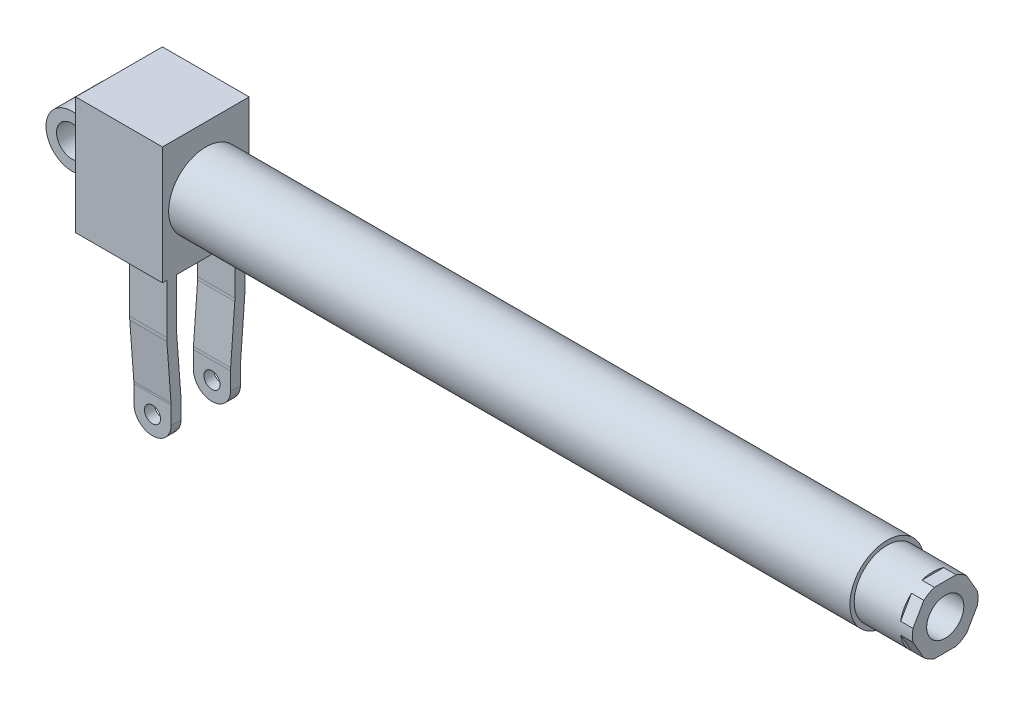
ISO-10303-21;
HEADER;
FILE_DESCRIPTION(('STEP AP214'),'2;1');
FILE_NAME('part.step','',(''),(''),'','','');
FILE_SCHEMA(('AUTOMOTIVE_DESIGN { 1 0 10303 214 1 1 1 1 }'));
ENDSEC;
DATA;
#1=APPLICATION_CONTEXT('core data for automotive mechanical design processes');
#2=APPLICATION_PROTOCOL_DEFINITION('international standard','automotive_design',2000,#1);
#3=PRODUCT_CONTEXT('',#1,'mechanical');
#4=PRODUCT('Part','Part','',(#3));
#5=PRODUCT_RELATED_PRODUCT_CATEGORY('part','',(#4));
#6=PRODUCT_DEFINITION_FORMATION('','',#4);
#7=PRODUCT_DEFINITION_CONTEXT('part definition',#1,'design');
#8=PRODUCT_DEFINITION('design','',#6,#7);
#9=PRODUCT_DEFINITION_SHAPE('','',#8);
#10=(LENGTH_UNIT() NAMED_UNIT(*) SI_UNIT(.MILLI.,.METRE.));
#11=(NAMED_UNIT(*) PLANE_ANGLE_UNIT() SI_UNIT($,.RADIAN.));
#12=(NAMED_UNIT(*) SI_UNIT($,.STERADIAN.) SOLID_ANGLE_UNIT());
#13=UNCERTAINTY_MEASURE_WITH_UNIT(LENGTH_MEASURE(1.E-05),#10,'distance_accuracy_value','');
#14=(GEOMETRIC_REPRESENTATION_CONTEXT(3) GLOBAL_UNCERTAINTY_ASSIGNED_CONTEXT((#13)) GLOBAL_UNIT_ASSIGNED_CONTEXT((#10,
#11,#12)) REPRESENTATION_CONTEXT('',''));
#15=CARTESIAN_POINT('',(0.,0.,0.));
#16=DIRECTION('',(0.,0.,1.));
#17=DIRECTION('',(1.,0.,0.));
#18=AXIS2_PLACEMENT_3D('',#15,#16,#17);
#19=CARTESIAN_POINT('',(88.,0.,0.));
#20=DIRECTION('',(1.,0.,0.));
#21=DIRECTION('',(0.,0.,-1.));
#22=AXIS2_PLACEMENT_3D('',#19,#20,#21);
#23=PLANE('',#22);
#24=CARTESIAN_POINT('',(88.,0.,0.));
#25=DIRECTION('',(-1.,0.,0.));
#26=DIRECTION('',(0.,0.,1.));
#27=AXIS2_PLACEMENT_3D('',#24,#25,#26);
#28=CIRCLE('',#27,20.);
#29=CARTESIAN_POINT('',(88.,0.,20.));
#30=VERTEX_POINT('',#29);
#31=EDGE_CURVE('E19',#30,#30,#28,.F.);
#32=ORIENTED_EDGE('',*,*,#31,.T.);
#33=EDGE_LOOP('',(#32));
#34=FACE_BOUND('',#33,.T.);
#35=ADVANCED_FACE('F15',(#34),#23,.T.);
#36=CARTESIAN_POINT('',(618.,0.,0.));
#37=DIRECTION('',(-1.,0.,0.));
#38=DIRECTION('',(0.,0.,1.));
#39=AXIS2_PLACEMENT_3D('',#36,#37,#38);
#40=CYLINDRICAL_SURFACE('',#39,20.);
#41=ORIENTED_EDGE('',*,*,#31,.F.);
#42=EDGE_LOOP('',(#41));
#43=FACE_BOUND('',#42,.T.);
#44=CARTESIAN_POINT('',(618.,0.,0.));
#45=DIRECTION('',(-1.,0.,0.));
#46=DIRECTION('',(0.,0.,1.));
#47=AXIS2_PLACEMENT_3D('',#44,#45,#46);
#48=CIRCLE('',#47,20.);
#49=CARTESIAN_POINT('',(618.,0.,20.));
#50=VERTEX_POINT('',#49);
#51=EDGE_CURVE('E396',#50,#50,#48,.F.);
#52=ORIENTED_EDGE('',*,*,#51,.T.);
#53=EDGE_LOOP('',(#52));
#54=FACE_BOUND('',#53,.T.);
#55=ADVANCED_FACE('F404',(#43,#54),#40,.F.);
#56=CARTESIAN_POINT('',(618.,0.,0.));
#57=DIRECTION('',(1.,0.,0.));
#58=DIRECTION('',(0.,0.,-1.));
#59=AXIS2_PLACEMENT_3D('',#56,#57,#58);
#60=PLANE('',#59);
#61=ORIENTED_EDGE('',*,*,#51,.F.);
#62=EDGE_LOOP('',(#61));
#63=FACE_BOUND('',#62,.T.);
#64=CARTESIAN_POINT('',(618.,0.,0.));
#65=DIRECTION('',(-1.,0.,0.));
#66=DIRECTION('',(0.,0.,1.));
#67=AXIS2_PLACEMENT_3D('',#64,#65,#66);
#68=CIRCLE('',#67,15.);
#69=CARTESIAN_POINT('',(618.,0.,15.));
#70=VERTEX_POINT('',#69);
#71=EDGE_CURVE('E394',#70,#70,#68,.F.);
#72=ORIENTED_EDGE('',*,*,#71,.T.);
#73=EDGE_LOOP('',(#72));
#74=FACE_BOUND('',#73,.T.);
#75=ADVANCED_FACE('F406',(#63,#74),#60,.F.);
#76=CARTESIAN_POINT('',(0.,0.,20.));
#77=DIRECTION('',(0.,0.,-1.));
#78=DIRECTION('',(-1.,0.,0.));
#79=AXIS2_PLACEMENT_3D('',#76,#77,#78);
#80=CYLINDRICAL_SURFACE('',#79,12.5);
#81=CARTESIAN_POINT('',(0.,0.,20.));
#82=DIRECTION('',(0.,0.,-1.));
#83=DIRECTION('',(-1.,0.,0.));
#84=AXIS2_PLACEMENT_3D('',#81,#82,#83);
#85=CIRCLE('',#84,12.5);
#86=CARTESIAN_POINT('',(-12.5,0.,20.));
#87=VERTEX_POINT('',#86);
#88=EDGE_CURVE('E215',#87,#87,#85,.T.);
#89=ORIENTED_EDGE('',*,*,#88,.F.);
#90=EDGE_LOOP('',(#89));
#91=FACE_BOUND('',#90,.T.);
#92=CARTESIAN_POINT('',(0.,0.,-20.));
#93=DIRECTION('',(0.,0.,-1.));
#94=DIRECTION('',(-1.,0.,0.));
#95=AXIS2_PLACEMENT_3D('',#92,#93,#94);
#96=CIRCLE('',#95,12.5);
#97=CARTESIAN_POINT('',(-12.5,0.,-20.));
#98=VERTEX_POINT('',#97);
#99=EDGE_CURVE('E216',#98,#98,#96,.T.);
#100=ORIENTED_EDGE('',*,*,#99,.T.);
#101=EDGE_LOOP('',(#100));
#102=FACE_BOUND('',#101,.T.);
#103=ADVANCED_FACE('F413',(#91,#102),#80,.F.);
#104=CARTESIAN_POINT('',(685.,0.,0.));
#105=DIRECTION('',(-1.,0.,0.));
#106=DIRECTION('',(0.,0.,1.));
#107=AXIS2_PLACEMENT_3D('',#104,#105,#106);
#108=CYLINDRICAL_SURFACE('',#107,15.);
#109=CARTESIAN_POINT('',(685.,0.,0.));
#110=DIRECTION('',(-1.,0.,0.));
#111=DIRECTION('',(0.,0.,1.));
#112=AXIS2_PLACEMENT_3D('',#109,#110,#111);
#113=CIRCLE('',#112,15.);
#114=CARTESIAN_POINT('',(685.,0.,15.));
#115=VERTEX_POINT('',#114);
#116=EDGE_CURVE('E383',#115,#115,#113,.T.);
#117=ORIENTED_EDGE('',*,*,#116,.F.);
#118=EDGE_LOOP('',(#117));
#119=FACE_BOUND('',#118,.T.);
#120=ORIENTED_EDGE('',*,*,#71,.F.);
#121=EDGE_LOOP('',(#120));
#122=FACE_BOUND('',#121,.T.);
#123=ADVANCED_FACE('F620',(#119,#122),#108,.F.);
#124=CARTESIAN_POINT('',(0.,0.,-20.));
#125=DIRECTION('',(0.,0.,1.));
#126=DIRECTION('',(1.,0.,0.));
#127=AXIS2_PLACEMENT_3D('',#124,#125,#126);
#128=PLANE('',#127);
#129=CARTESIAN_POINT('',(0.,0.,-20.));
#130=DIRECTION('',(0.,0.,-1.));
#131=DIRECTION('',(-1.,0.,0.));
#132=AXIS2_PLACEMENT_3D('',#129,#130,#131);
#133=CIRCLE('',#132,21.);
#134=CARTESIAN_POINT('',(18.,10.816653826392,-20.));
#135=VERTEX_POINT('',#134);
#136=CARTESIAN_POINT('',(18.,-10.816653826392,-20.));
#137=VERTEX_POINT('',#136);
#138=EDGE_CURVE('E209',#135,#137,#133,.F.);
#139=ORIENTED_EDGE('',*,*,#138,.F.);
#140=DIRECTION('',(0.,1.,0.));
#141=VECTOR('',#140,1.);
#142=CARTESIAN_POINT('',(18.,47.5,-20.));
#143=LINE('',#142,#141);
#144=EDGE_CURVE('E207',#135,#137,#143,.F.);
#145=ORIENTED_EDGE('',*,*,#144,.T.);
#146=EDGE_LOOP('',(#139,#145));
#147=FACE_BOUND('',#146,.T.);
#148=ORIENTED_EDGE('',*,*,#99,.F.);
#149=EDGE_LOOP('',(#148));
#150=FACE_BOUND('',#149,.T.);
#151=ADVANCED_FACE('F211',(#147,#150),#128,.F.);
#152=CARTESIAN_POINT('',(0.,0.,20.));
#153=DIRECTION('',(0.,0.,-1.));
#154=DIRECTION('',(-1.,0.,0.));
#155=AXIS2_PLACEMENT_3D('',#152,#153,#154);
#156=CYLINDRICAL_SURFACE('',#155,21.);
#157=ORIENTED_EDGE('',*,*,#138,.T.);
#158=DIRECTION('',(0.,0.,1.));
#159=VECTOR('',#158,1.);
#160=CARTESIAN_POINT('',(18.,-10.816653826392,35.));
#161=LINE('',#160,#159);
#162=CARTESIAN_POINT('',(18.,-10.816653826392,20.));
#163=VERTEX_POINT('',#162);
#164=EDGE_CURVE('E230',#137,#163,#161,.T.);
#165=ORIENTED_EDGE('',*,*,#164,.T.);
#166=CARTESIAN_POINT('',(0.,0.,20.));
#167=DIRECTION('',(0.,0.,-1.));
#168=DIRECTION('',(-1.,0.,0.));
#169=AXIS2_PLACEMENT_3D('',#166,#167,#168);
#170=CIRCLE('',#169,21.);
#171=CARTESIAN_POINT('',(18.,10.816653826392,20.));
#172=VERTEX_POINT('',#171);
#173=EDGE_CURVE('E222',#172,#163,#170,.F.);
#174=ORIENTED_EDGE('',*,*,#173,.F.);
#175=DIRECTION('',(0.,0.,1.));
#176=VECTOR('',#175,1.);
#177=CARTESIAN_POINT('',(18.,10.816653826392,35.));
#178=LINE('',#177,#176);
#179=EDGE_CURVE('E219',#172,#135,#178,.F.);
#180=ORIENTED_EDGE('',*,*,#179,.T.);
#181=EDGE_LOOP('',(#157,#165,#174,#180));
#182=FACE_BOUND('',#181,.T.);
#183=ADVANCED_FACE('F220',(#182),#156,.T.);
#184=CARTESIAN_POINT('',(0.,0.,20.));
#185=DIRECTION('',(0.,0.,1.));
#186=DIRECTION('',(1.,0.,0.));
#187=AXIS2_PLACEMENT_3D('',#184,#185,#186);
#188=PLANE('',#187);
#189=ORIENTED_EDGE('',*,*,#173,.T.);
#190=DIRECTION('',(0.,1.,0.));
#191=VECTOR('',#190,1.);
#192=CARTESIAN_POINT('',(18.,47.5,20.));
#193=LINE('',#192,#191);
#194=EDGE_CURVE('E232',#163,#172,#193,.T.);
#195=ORIENTED_EDGE('',*,*,#194,.T.);
#196=EDGE_LOOP('',(#189,#195));
#197=FACE_BOUND('',#196,.T.);
#198=ORIENTED_EDGE('',*,*,#88,.T.);
#199=EDGE_LOOP('',(#198));
#200=FACE_BOUND('',#199,.T.);
#201=ADVANCED_FACE('F611',(#197,#200),#188,.T.);
#202=CARTESIAN_POINT('',(675.,1.50318354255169E-13,0.));
#203=DIRECTION('',(1.,0.,0.));
#204=DIRECTION('',(0.,1.,0.));
#205=AXIS2_PLACEMENT_3D('',#202,#203,#204);
#206=PLANE('',#205);
#207=CARTESIAN_POINT('',(675.,2.57652086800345E-13,0.));
#208=DIRECTION('',(-1.,0.,0.));
#209=DIRECTION('',(0.,-1.,0.));
#210=AXIS2_PLACEMENT_3D('',#207,#208,#209);
#211=CIRCLE('',#210,26.5);
#212=CARTESIAN_POINT('',(675.,20.1116686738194,-17.2560361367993));
#213=VERTEX_POINT('',#212);
#214=CARTESIAN_POINT('',(675.,4.8883313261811,-26.0452340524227));
#215=VERTEX_POINT('',#214);
#216=EDGE_CURVE('E367',#213,#215,#211,.T.);
#217=ORIENTED_EDGE('',*,*,#216,.F.);
#218=DIRECTION('',(0.,0.866025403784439,0.5));
#219=VECTOR('',#218,1.);
#220=CARTESIAN_POINT('',(675.,2.95816003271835E-13,-28.8675134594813));
#221=LINE('',#220,#219);
#222=EDGE_CURVE('E389',#215,#213,#221,.T.);
#223=ORIENTED_EDGE('',*,*,#222,.F.);
#224=EDGE_LOOP('',(#217,#223));
#225=FACE_BOUND('',#224,.T.);
#226=ADVANCED_FACE('F607',(#225),#206,.T.);
#227=CARTESIAN_POINT('',(675.,2.95816003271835E-13,-28.8675134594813));
#228=DIRECTION('',(0.,0.5,-0.866025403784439));
#229=DIRECTION('',(0.,0.866025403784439,0.5));
#230=AXIS2_PLACEMENT_3D('',#227,#228,#229);
#231=PLANE('',#230);
#232=DIRECTION('',(-1.,0.,0.));
#233=VECTOR('',#232,1.);
#234=CARTESIAN_POINT('',(685.,20.1116686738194,-17.2560361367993));
#235=LINE('',#234,#233);
#236=CARTESIAN_POINT('',(685.,20.1116686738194,-17.2560361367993));
#237=VERTEX_POINT('',#236);
#238=EDGE_CURVE('E370',#237,#213,#235,.T.);
#239=ORIENTED_EDGE('',*,*,#238,.F.);
#240=DIRECTION('',(0.,0.866025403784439,0.499999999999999));
#241=VECTOR('',#240,1.);
#242=CARTESIAN_POINT('',(685.,4.8883313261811,-26.0452340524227));
#243=LINE('',#242,#241);
#244=CARTESIAN_POINT('',(685.,4.88833132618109,-26.0452340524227));
#245=VERTEX_POINT('',#244);
#246=EDGE_CURVE('E387',#245,#237,#243,.T.);
#247=ORIENTED_EDGE('',*,*,#246,.F.);
#248=DIRECTION('',(-1.,0.,0.));
#249=VECTOR('',#248,1.);
#250=CARTESIAN_POINT('',(685.,4.8883313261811,-26.0452340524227));
#251=LINE('',#250,#249);
#252=EDGE_CURVE('E366',#215,#245,#251,.F.);
#253=ORIENTED_EDGE('',*,*,#252,.F.);
#254=ORIENTED_EDGE('',*,*,#222,.T.);
#255=EDGE_LOOP('',(#239,#247,#253,#254));
#256=FACE_BOUND('',#255,.T.);
#257=ADVANCED_FACE('F603',(#256),#231,.T.);
#258=CARTESIAN_POINT('',(675.,1.50318354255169E-13,0.));
#259=DIRECTION('',(1.,0.,0.));
#260=DIRECTION('',(0.,1.,0.));
#261=AXIS2_PLACEMENT_3D('',#258,#259,#260);
#262=PLANE('',#261);
#263=CARTESIAN_POINT('',(675.,2.57652086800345E-13,0.));
#264=DIRECTION('',(-1.,0.,0.));
#265=DIRECTION('',(0.,-1.,0.));
#266=AXIS2_PLACEMENT_3D('',#263,#264,#265);
#267=CIRCLE('',#266,26.5);
#268=CARTESIAN_POINT('',(675.,-4.88833132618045,-26.0452340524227));
#269=VERTEX_POINT('',#268);
#270=CARTESIAN_POINT('',(675.,-20.111668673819,-17.2560361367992));
#271=VERTEX_POINT('',#270);
#272=EDGE_CURVE('E359',#269,#271,#267,.T.);
#273=ORIENTED_EDGE('',*,*,#272,.F.);
#274=DIRECTION('',(0.,0.866025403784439,-0.5));
#275=VECTOR('',#274,1.);
#276=CARTESIAN_POINT('',(675.,-24.9999999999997,-14.4337567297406));
#277=LINE('',#276,#275);
#278=EDGE_CURVE('E874',#271,#269,#277,.T.);
#279=ORIENTED_EDGE('',*,*,#278,.F.);
#280=EDGE_LOOP('',(#273,#279));
#281=FACE_BOUND('',#280,.T.);
#282=ADVANCED_FACE('F599',(#281),#262,.T.);
#283=CARTESIAN_POINT('',(675.,-24.9999999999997,-14.4337567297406));
#284=DIRECTION('',(0.,-0.5,-0.866025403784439));
#285=DIRECTION('',(0.,0.866025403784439,-0.5));
#286=AXIS2_PLACEMENT_3D('',#283,#284,#285);
#287=PLANE('',#286);
#288=DIRECTION('',(-1.,0.,0.));
#289=VECTOR('',#288,1.);
#290=CARTESIAN_POINT('',(685.,-4.88833132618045,-26.0452340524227));
#291=LINE('',#290,#289);
#292=CARTESIAN_POINT('',(685.,-4.88833132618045,-26.0452340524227));
#293=VERTEX_POINT('',#292);
#294=EDGE_CURVE('E362',#293,#269,#291,.T.);
#295=ORIENTED_EDGE('',*,*,#294,.F.);
#296=DIRECTION('',(0.,0.866025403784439,-0.5));
#297=VECTOR('',#296,1.);
#298=CARTESIAN_POINT('',(685.,-20.111668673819,-17.2560361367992));
#299=LINE('',#298,#297);
#300=CARTESIAN_POINT('',(685.,-20.111668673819,-17.2560361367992));
#301=VERTEX_POINT('',#300);
#302=EDGE_CURVE('E1116',#301,#293,#299,.T.);
#303=ORIENTED_EDGE('',*,*,#302,.F.);
#304=DIRECTION('',(-1.,0.,0.));
#305=VECTOR('',#304,1.);
#306=CARTESIAN_POINT('',(685.,-20.111668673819,-17.2560361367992));
#307=LINE('',#306,#305);
#308=EDGE_CURVE('E358',#271,#301,#307,.F.);
#309=ORIENTED_EDGE('',*,*,#308,.F.);
#310=ORIENTED_EDGE('',*,*,#278,.T.);
#311=EDGE_LOOP('',(#295,#303,#309,#310));
#312=FACE_BOUND('',#311,.T.);
#313=ADVANCED_FACE('F595',(#312),#287,.T.);
#314=CARTESIAN_POINT('',(675.,1.50318354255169E-13,0.));
#315=DIRECTION('',(1.,0.,0.));
#316=DIRECTION('',(0.,1.,0.));
#317=AXIS2_PLACEMENT_3D('',#314,#315,#316);
#318=PLANE('',#317);
#319=CARTESIAN_POINT('',(675.,2.57652086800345E-13,0.));
#320=DIRECTION('',(-1.,0.,0.));
#321=DIRECTION('',(0.,-1.,0.));
#322=AXIS2_PLACEMENT_3D('',#319,#320,#321);
#323=CIRCLE('',#322,26.5);
#324=CARTESIAN_POINT('',(675.,25.0000000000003,8.78919791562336));
#325=VERTEX_POINT('',#324);
#326=CARTESIAN_POINT('',(675.,25.0000000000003,-8.78919791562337));
#327=VERTEX_POINT('',#326);
#328=EDGE_CURVE('E352',#325,#327,#323,.T.);
#329=ORIENTED_EDGE('',*,*,#328,.F.);
#330=DIRECTION('',(0.,0.,1.));
#331=VECTOR('',#330,1.);
#332=CARTESIAN_POINT('',(675.,25.0000000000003,-14.4337567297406));
#333=LINE('',#332,#331);
#334=EDGE_CURVE('E386',#327,#325,#333,.T.);
#335=ORIENTED_EDGE('',*,*,#334,.F.);
#336=EDGE_LOOP('',(#329,#335));
#337=FACE_BOUND('',#336,.T.);
#338=ADVANCED_FACE('F591',(#337),#318,.T.);
#339=CARTESIAN_POINT('',(675.,1.50318354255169E-13,0.));
#340=DIRECTION('',(1.,0.,0.));
#341=DIRECTION('',(0.,1.,0.));
#342=AXIS2_PLACEMENT_3D('',#339,#340,#341);
#343=PLANE('',#342);
#344=CARTESIAN_POINT('',(675.,2.57652086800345E-13,0.));
#345=DIRECTION('',(-1.,0.,0.));
#346=DIRECTION('',(0.,-1.,0.));
#347=AXIS2_PLACEMENT_3D('',#344,#345,#346);
#348=CIRCLE('',#347,26.5);
#349=CARTESIAN_POINT('',(675.,-24.9999999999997,-8.78919791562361));
#350=VERTEX_POINT('',#349);
#351=CARTESIAN_POINT('',(675.,-24.9999999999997,8.78919791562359));
#352=VERTEX_POINT('',#351);
#353=EDGE_CURVE('E349',#350,#352,#348,.T.);
#354=ORIENTED_EDGE('',*,*,#353,.F.);
#355=DIRECTION('',(0.,0.,1.));
#356=VECTOR('',#355,1.);
#357=CARTESIAN_POINT('',(675.,-24.9999999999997,14.4337567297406));
#358=LINE('',#357,#356);
#359=EDGE_CURVE('E880',#352,#350,#358,.F.);
#360=ORIENTED_EDGE('',*,*,#359,.F.);
#361=EDGE_LOOP('',(#354,#360));
#362=FACE_BOUND('',#361,.T.);
#363=ADVANCED_FACE('F587',(#362),#343,.T.);
#364=CARTESIAN_POINT('',(675.,-24.9999999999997,14.4337567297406));
#365=DIRECTION('',(0.,-1.,0.));
#366=DIRECTION('',(1.,0.,0.));
#367=AXIS2_PLACEMENT_3D('',#364,#365,#366);
#368=PLANE('',#367);
#369=DIRECTION('',(-1.,0.,0.));
#370=VECTOR('',#369,1.);
#371=CARTESIAN_POINT('',(685.,-24.9999999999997,-8.78919791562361));
#372=LINE('',#371,#370);
#373=CARTESIAN_POINT('',(685.,-24.9999999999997,-8.7891979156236));
#374=VERTEX_POINT('',#373);
#375=EDGE_CURVE('E354',#374,#350,#372,.T.);
#376=ORIENTED_EDGE('',*,*,#375,.F.);
#377=DIRECTION('',(0.,0.,1.));
#378=VECTOR('',#377,1.);
#379=CARTESIAN_POINT('',(685.,-24.9999999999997,0.));
#380=LINE('',#379,#378);
#381=CARTESIAN_POINT('',(685.,-24.9999999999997,8.78919791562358));
#382=VERTEX_POINT('',#381);
#383=EDGE_CURVE('E1114',#382,#374,#380,.F.);
#384=ORIENTED_EDGE('',*,*,#383,.F.);
#385=DIRECTION('',(-1.,0.,0.));
#386=VECTOR('',#385,1.);
#387=CARTESIAN_POINT('',(685.,-24.9999999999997,8.78919791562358));
#388=LINE('',#387,#386);
#389=EDGE_CURVE('E348',#352,#382,#388,.F.);
#390=ORIENTED_EDGE('',*,*,#389,.F.);
#391=ORIENTED_EDGE('',*,*,#359,.T.);
#392=EDGE_LOOP('',(#376,#384,#390,#391));
#393=FACE_BOUND('',#392,.T.);
#394=ADVANCED_FACE('F583',(#393),#368,.T.);
#395=CARTESIAN_POINT('',(675.,1.50318354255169E-13,0.));
#396=DIRECTION('',(1.,0.,0.));
#397=DIRECTION('',(0.,1.,0.));
#398=AXIS2_PLACEMENT_3D('',#395,#396,#397);
#399=PLANE('',#398);
#400=CARTESIAN_POINT('',(675.,2.57652086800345E-13,0.));
#401=DIRECTION('',(-1.,0.,0.));
#402=DIRECTION('',(0.,-1.,0.));
#403=AXIS2_PLACEMENT_3D('',#400,#401,#402);
#404=CIRCLE('',#403,26.5);
#405=CARTESIAN_POINT('',(675.,-20.111668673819,17.2560361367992));
#406=VERTEX_POINT('',#405);
#407=CARTESIAN_POINT('',(675.,-4.88833132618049,26.0452340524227));
#408=VERTEX_POINT('',#407);
#409=EDGE_CURVE('E341',#406,#408,#404,.T.);
#410=ORIENTED_EDGE('',*,*,#409,.F.);
#411=DIRECTION('',(0.,-0.866025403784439,-0.5));
#412=VECTOR('',#411,1.);
#413=CARTESIAN_POINT('',(675.,2.95816003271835E-13,28.8675134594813));
#414=LINE('',#413,#412);
#415=EDGE_CURVE('E888',#408,#406,#414,.T.);
#416=ORIENTED_EDGE('',*,*,#415,.F.);
#417=EDGE_LOOP('',(#410,#416));
#418=FACE_BOUND('',#417,.T.);
#419=ADVANCED_FACE('F579',(#418),#399,.T.);
#420=CARTESIAN_POINT('',(675.,2.95816003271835E-13,28.8675134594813));
#421=DIRECTION('',(0.,-0.5,0.866025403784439));
#422=DIRECTION('',(0.,-0.866025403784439,-0.5));
#423=AXIS2_PLACEMENT_3D('',#420,#421,#422);
#424=PLANE('',#423);
#425=DIRECTION('',(-1.,0.,0.));
#426=VECTOR('',#425,1.);
#427=CARTESIAN_POINT('',(685.,-20.111668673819,17.2560361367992));
#428=LINE('',#427,#426);
#429=CARTESIAN_POINT('',(685.,-20.111668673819,17.2560361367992));
#430=VERTEX_POINT('',#429);
#431=EDGE_CURVE('E344',#430,#406,#428,.T.);
#432=ORIENTED_EDGE('',*,*,#431,.F.);
#433=DIRECTION('',(0.,-0.866025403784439,-0.5));
#434=VECTOR('',#433,1.);
#435=CARTESIAN_POINT('',(685.,-4.88833132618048,26.0452340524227));
#436=LINE('',#435,#434);
#437=CARTESIAN_POINT('',(685.,-4.88833132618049,26.0452340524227));
#438=VERTEX_POINT('',#437);
#439=EDGE_CURVE('E1112',#438,#430,#436,.T.);
#440=ORIENTED_EDGE('',*,*,#439,.F.);
#441=DIRECTION('',(-1.,0.,0.));
#442=VECTOR('',#441,1.);
#443=CARTESIAN_POINT('',(685.,-4.88833132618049,26.0452340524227));
#444=LINE('',#443,#442);
#445=EDGE_CURVE('E340',#408,#438,#444,.F.);
#446=ORIENTED_EDGE('',*,*,#445,.F.);
#447=ORIENTED_EDGE('',*,*,#415,.T.);
#448=EDGE_LOOP('',(#432,#440,#446,#447));
#449=FACE_BOUND('',#448,.T.);
#450=ADVANCED_FACE('F575',(#449),#424,.T.);
#451=CARTESIAN_POINT('',(675.,1.50318354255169E-13,0.));
#452=DIRECTION('',(1.,0.,0.));
#453=DIRECTION('',(0.,1.,0.));
#454=AXIS2_PLACEMENT_3D('',#451,#452,#453);
#455=PLANE('',#454);
#456=CARTESIAN_POINT('',(675.,2.57652086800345E-13,0.));
#457=DIRECTION('',(-1.,0.,0.));
#458=DIRECTION('',(0.,-1.,0.));
#459=AXIS2_PLACEMENT_3D('',#456,#457,#458);
#460=CIRCLE('',#459,26.5);
#461=CARTESIAN_POINT('',(675.,4.88833132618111,26.0452340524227));
#462=VERTEX_POINT('',#461);
#463=CARTESIAN_POINT('',(675.,20.1116686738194,17.2560361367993));
#464=VERTEX_POINT('',#463);
#465=EDGE_CURVE('E333',#462,#464,#460,.T.);
#466=ORIENTED_EDGE('',*,*,#465,.F.);
#467=DIRECTION('',(0.,-0.866025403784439,0.5));
#468=VECTOR('',#467,1.);
#469=CARTESIAN_POINT('',(675.,25.0000000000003,14.4337567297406));
#470=LINE('',#469,#468);
#471=EDGE_CURVE('E894',#464,#462,#470,.T.);
#472=ORIENTED_EDGE('',*,*,#471,.F.);
#473=EDGE_LOOP('',(#466,#472));
#474=FACE_BOUND('',#473,.T.);
#475=ADVANCED_FACE('F571',(#474),#455,.T.);
#476=CARTESIAN_POINT('',(675.,25.0000000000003,14.4337567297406));
#477=DIRECTION('',(0.,0.5,0.866025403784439));
#478=DIRECTION('',(0.,-0.866025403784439,0.5));
#479=AXIS2_PLACEMENT_3D('',#476,#477,#478);
#480=PLANE('',#479);
#481=DIRECTION('',(-1.,0.,0.));
#482=VECTOR('',#481,1.);
#483=CARTESIAN_POINT('',(685.,4.88833132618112,26.0452340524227));
#484=LINE('',#483,#482);
#485=CARTESIAN_POINT('',(685.,4.88833132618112,26.0452340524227));
#486=VERTEX_POINT('',#485);
#487=EDGE_CURVE('E336',#486,#462,#484,.T.);
#488=ORIENTED_EDGE('',*,*,#487,.F.);
#489=DIRECTION('',(0.,-0.866025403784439,0.5));
#490=VECTOR('',#489,1.);
#491=CARTESIAN_POINT('',(685.,20.1116686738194,17.2560361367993));
#492=LINE('',#491,#490);
#493=CARTESIAN_POINT('',(685.,20.1116686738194,17.2560361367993));
#494=VERTEX_POINT('',#493);
#495=EDGE_CURVE('E900',#494,#486,#492,.T.);
#496=ORIENTED_EDGE('',*,*,#495,.F.);
#497=DIRECTION('',(-1.,0.,0.));
#498=VECTOR('',#497,1.);
#499=CARTESIAN_POINT('',(685.,20.1116686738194,17.2560361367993));
#500=LINE('',#499,#498);
#501=EDGE_CURVE('E332',#464,#494,#500,.F.);
#502=ORIENTED_EDGE('',*,*,#501,.F.);
#503=ORIENTED_EDGE('',*,*,#471,.T.);
#504=EDGE_LOOP('',(#488,#496,#502,#503));
#505=FACE_BOUND('',#504,.T.);
#506=ADVANCED_FACE('F567',(#505),#480,.T.);
#507=CARTESIAN_POINT('',(685.,2.62034546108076E-13,0.));
#508=DIRECTION('',(1.,0.,0.));
#509=DIRECTION('',(0.,1.,0.));
#510=AXIS2_PLACEMENT_3D('',#507,#508,#509);
#511=PLANE('',#510);
#512=ORIENTED_EDGE('',*,*,#116,.T.);
#513=EDGE_LOOP('',(#512));
#514=FACE_BOUND('',#513,.T.);
#515=CARTESIAN_POINT('',(685.,2.62034546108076E-13,0.));
#516=DIRECTION('',(-1.,0.,0.));
#517=DIRECTION('',(0.,-1.,0.));
#518=AXIS2_PLACEMENT_3D('',#515,#516,#517);
#519=CIRCLE('',#518,26.5);
#520=CARTESIAN_POINT('',(685.,25.0000000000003,-8.78919791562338));
#521=VERTEX_POINT('',#520);
#522=EDGE_CURVE('E371',#521,#237,#519,.T.);
#523=ORIENTED_EDGE('',*,*,#522,.F.);
#524=DIRECTION('',(0.,0.,1.));
#525=VECTOR('',#524,1.);
#526=CARTESIAN_POINT('',(685.,25.0000000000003,-14.4337567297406));
#527=LINE('',#526,#525);
#528=CARTESIAN_POINT('',(685.,25.0000000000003,8.78919791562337));
#529=VERTEX_POINT('',#528);
#530=EDGE_CURVE('E382',#529,#521,#527,.F.);
#531=ORIENTED_EDGE('',*,*,#530,.F.);
#532=CARTESIAN_POINT('',(685.,2.62034546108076E-13,0.));
#533=DIRECTION('',(-1.,0.,0.));
#534=DIRECTION('',(0.,-1.,0.));
#535=AXIS2_PLACEMENT_3D('',#532,#533,#534);
#536=CIRCLE('',#535,26.5);
#537=EDGE_CURVE('E328',#494,#529,#536,.T.);
#538=ORIENTED_EDGE('',*,*,#537,.F.);
#539=ORIENTED_EDGE('',*,*,#495,.T.);
#540=CARTESIAN_POINT('',(685.,2.62034546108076E-13,0.));
#541=DIRECTION('',(-1.,0.,0.));
#542=DIRECTION('',(0.,-1.,0.));
#543=AXIS2_PLACEMENT_3D('',#540,#541,#542);
#544=CIRCLE('',#543,26.5);
#545=EDGE_CURVE('E337',#438,#486,#544,.T.);
#546=ORIENTED_EDGE('',*,*,#545,.F.);
#547=ORIENTED_EDGE('',*,*,#439,.T.);
#548=CARTESIAN_POINT('',(685.,2.62034546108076E-13,0.));
#549=DIRECTION('',(-1.,0.,0.));
#550=DIRECTION('',(0.,-1.,0.));
#551=AXIS2_PLACEMENT_3D('',#548,#549,#550);
#552=CIRCLE('',#551,26.5);
#553=EDGE_CURVE('E345',#382,#430,#552,.T.);
#554=ORIENTED_EDGE('',*,*,#553,.F.);
#555=ORIENTED_EDGE('',*,*,#383,.T.);
#556=CARTESIAN_POINT('',(685.,2.62034546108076E-13,0.));
#557=DIRECTION('',(-1.,0.,0.));
#558=DIRECTION('',(0.,-1.,0.));
#559=AXIS2_PLACEMENT_3D('',#556,#557,#558);
#560=CIRCLE('',#559,26.5);
#561=EDGE_CURVE('E355',#301,#374,#560,.T.);
#562=ORIENTED_EDGE('',*,*,#561,.F.);
#563=ORIENTED_EDGE('',*,*,#302,.T.);
#564=CARTESIAN_POINT('',(685.,2.62034546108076E-13,0.));
#565=DIRECTION('',(-1.,0.,0.));
#566=DIRECTION('',(0.,-1.,0.));
#567=AXIS2_PLACEMENT_3D('',#564,#565,#566);
#568=CIRCLE('',#567,26.5);
#569=EDGE_CURVE('E363',#245,#293,#568,.T.);
#570=ORIENTED_EDGE('',*,*,#569,.F.);
#571=ORIENTED_EDGE('',*,*,#246,.T.);
#572=EDGE_LOOP('',(#523,#531,#538,#539,#546,#547,#554,#555,#562,#563,#570,#571));
#573=FACE_BOUND('',#572,.T.);
#574=ADVANCED_FACE('F563',(#514,#573),#511,.T.);
#575=CARTESIAN_POINT('',(675.,25.0000000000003,-14.4337567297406));
#576=DIRECTION('',(0.,1.,0.));
#577=DIRECTION('',(-1.,0.,0.));
#578=AXIS2_PLACEMENT_3D('',#575,#576,#577);
#579=PLANE('',#578);
#580=DIRECTION('',(-1.,0.,0.));
#581=VECTOR('',#580,1.);
#582=CARTESIAN_POINT('',(685.,25.0000000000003,8.78919791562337));
#583=LINE('',#582,#581);
#584=EDGE_CURVE('E331',#529,#325,#583,.T.);
#585=ORIENTED_EDGE('',*,*,#584,.F.);
#586=ORIENTED_EDGE('',*,*,#530,.T.);
#587=DIRECTION('',(-1.,0.,0.));
#588=VECTOR('',#587,1.);
#589=CARTESIAN_POINT('',(685.,25.0000000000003,-8.78919791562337));
#590=LINE('',#589,#588);
#591=EDGE_CURVE('E374',#327,#521,#590,.F.);
#592=ORIENTED_EDGE('',*,*,#591,.F.);
#593=ORIENTED_EDGE('',*,*,#334,.T.);
#594=EDGE_LOOP('',(#585,#586,#592,#593));
#595=FACE_BOUND('',#594,.T.);
#596=ADVANCED_FACE('F559',(#595),#579,.T.);
#597=CARTESIAN_POINT('',(58.0000000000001,-136.618283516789,-50.));
#598=DIRECTION('',(1.,0.,0.));
#599=DIRECTION('',(0.,1.,0.));
#600=AXIS2_PLACEMENT_3D('',#597,#598,#599);
#601=CYLINDRICAL_SURFACE('',#600,22.);
#602=DIRECTION('',(1.,0.,0.));
#603=VECTOR('',#602,1.);
#604=CARTESIAN_POINT('',(58.0000000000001,-136.618283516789,-28.));
#605=LINE('',#604,#603);
#606=CARTESIAN_POINT('',(88.,-136.618283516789,-28.));
#607=VERTEX_POINT('',#606);
#608=CARTESIAN_POINT('',(58.0000000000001,-136.618283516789,-28.));
#609=VERTEX_POINT('',#608);
#610=EDGE_CURVE('E316',#607,#609,#605,.F.);
#611=ORIENTED_EDGE('',*,*,#610,.T.);
#612=CARTESIAN_POINT('',(58.0000000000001,-136.618283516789,-50.));
#613=DIRECTION('',(1.,0.,0.));
#614=DIRECTION('',(0.,1.,0.));
#615=AXIS2_PLACEMENT_3D('',#612,#613,#614);
#616=CIRCLE('',#615,22.);
#617=CARTESIAN_POINT('',(58.0000000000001,-134.98041019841,-28.0610535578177));
#618=VERTEX_POINT('',#617);
#619=EDGE_CURVE('E379',#609,#618,#616,.F.);
#620=ORIENTED_EDGE('',*,*,#619,.T.);
#621=DIRECTION('',(1.,0.,0.));
#622=VECTOR('',#621,1.);
#623=CARTESIAN_POINT('',(58.,-134.98041019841,-28.0610535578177));
#624=LINE('',#623,#622);
#625=CARTESIAN_POINT('',(88.,-134.98041019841,-28.0610535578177));
#626=VERTEX_POINT('',#625);
#627=EDGE_CURVE('E317',#618,#626,#624,.T.);
#628=ORIENTED_EDGE('',*,*,#627,.T.);
#629=CARTESIAN_POINT('',(88.0000000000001,-136.618283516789,-50.));
#630=DIRECTION('',(1.,0.,0.));
#631=DIRECTION('',(0.,1.,0.));
#632=AXIS2_PLACEMENT_3D('',#629,#630,#631);
#633=CIRCLE('',#632,22.);
#634=EDGE_CURVE('E226',#607,#626,#633,.F.);
#635=ORIENTED_EDGE('',*,*,#634,.F.);
#636=EDGE_LOOP('',(#611,#620,#628,#635));
#637=FACE_BOUND('',#636,.T.);
#638=ADVANCED_FACE('F555',(#637),#601,.F.);
#639=CARTESIAN_POINT('',(73.0000000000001,-150.489175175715,-35.));
#640=DIRECTION('',(0.,0.,1.));
#641=DIRECTION('',(1.,0.,0.));
#642=AXIS2_PLACEMENT_3D('',#639,#640,#641);
#643=CYLINDRICAL_SURFACE('',#642,6.50000000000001);
#644=CARTESIAN_POINT('',(73.0000000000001,-150.489175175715,-20.));
#645=DIRECTION('',(0.,0.,1.));
#646=DIRECTION('',(1.,0.,0.));
#647=AXIS2_PLACEMENT_3D('',#644,#645,#646);
#648=CIRCLE('',#647,6.50000000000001);
#649=CARTESIAN_POINT('',(79.5000000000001,-150.489175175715,-20.));
#650=VERTEX_POINT('',#649);
#651=EDGE_CURVE('E306',#650,#650,#648,.F.);
#652=ORIENTED_EDGE('',*,*,#651,.F.);
#653=EDGE_LOOP('',(#652));
#654=FACE_BOUND('',#653,.T.);
#655=CARTESIAN_POINT('',(73.0000000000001,-150.489175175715,-28.));
#656=DIRECTION('',(0.,0.,1.));
#657=DIRECTION('',(1.,0.,0.));
#658=AXIS2_PLACEMENT_3D('',#655,#656,#657);
#659=CIRCLE('',#658,6.50000000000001);
#660=CARTESIAN_POINT('',(79.5000000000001,-150.489175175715,-28.));
#661=VERTEX_POINT('',#660);
#662=EDGE_CURVE('E313',#661,#661,#659,.F.);
#663=ORIENTED_EDGE('',*,*,#662,.T.);
#664=EDGE_LOOP('',(#663));
#665=FACE_BOUND('',#664,.T.);
#666=ADVANCED_FACE('F552',(#654,#665),#643,.F.);
#667=CARTESIAN_POINT('',(18.,47.5,35.));
#668=DIRECTION('',(1.,0.,0.));
#669=DIRECTION('',(0.,1.,0.));
#670=AXIS2_PLACEMENT_3D('',#667,#668,#669);
#671=PLANE('',#670);
#672=ORIENTED_EDGE('',*,*,#164,.F.);
#673=ORIENTED_EDGE('',*,*,#144,.F.);
#674=ORIENTED_EDGE('',*,*,#179,.F.);
#675=ORIENTED_EDGE('',*,*,#194,.F.);
#676=EDGE_LOOP('',(#672,#673,#674,#675));
#677=FACE_BOUND('',#676,.T.);
#678=DIRECTION('',(0.,0.,1.));
#679=VECTOR('',#678,1.);
#680=CARTESIAN_POINT('',(18.,-47.5,35.));
#681=LINE('',#680,#679);
#682=CARTESIAN_POINT('',(18.,-47.5,-35.));
#683=VERTEX_POINT('',#682);
#684=CARTESIAN_POINT('',(18.,-47.5,35.));
#685=VERTEX_POINT('',#684);
#686=EDGE_CURVE('E936',#683,#685,#681,.T.);
#687=ORIENTED_EDGE('',*,*,#686,.T.);
#688=DIRECTION('',(0.,1.,0.));
#689=VECTOR('',#688,1.);
#690=CARTESIAN_POINT('',(18.,-47.5,35.));
#691=LINE('',#690,#689);
#692=CARTESIAN_POINT('',(18.,47.5,35.));
#693=VERTEX_POINT('',#692);
#694=EDGE_CURVE('E943',#693,#685,#691,.F.);
#695=ORIENTED_EDGE('',*,*,#694,.F.);
#696=DIRECTION('',(0.,0.,-1.));
#697=VECTOR('',#696,1.);
#698=CARTESIAN_POINT('',(18.,47.5,35.));
#699=LINE('',#698,#697);
#700=CARTESIAN_POINT('',(18.,47.5,-35.));
#701=VERTEX_POINT('',#700);
#702=EDGE_CURVE('E910',#693,#701,#699,.T.);
#703=ORIENTED_EDGE('',*,*,#702,.T.);
#704=DIRECTION('',(0.,1.,0.));
#705=VECTOR('',#704,1.);
#706=CARTESIAN_POINT('',(18.,-47.5,-35.));
#707=LINE('',#706,#705);
#708=EDGE_CURVE('E929',#701,#683,#707,.F.);
#709=ORIENTED_EDGE('',*,*,#708,.T.);
#710=EDGE_LOOP('',(#687,#695,#703,#709));
#711=FACE_BOUND('',#710,.T.);
#712=ADVANCED_FACE('F228',(#677,#711),#671,.F.);
#713=CARTESIAN_POINT('',(58.0000000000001,-136.618283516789,-50.));
#714=DIRECTION('',(1.,0.,0.));
#715=DIRECTION('',(0.,1.,0.));
#716=AXIS2_PLACEMENT_3D('',#713,#714,#715);
#717=PLANE('',#716);
#718=DIRECTION('',(0.,0.,-1.));
#719=VECTOR('',#718,1.);
#720=CARTESIAN_POINT('',(58.0000000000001,-151.059141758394,955.3078096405));
#721=LINE('',#720,#719);
#722=CARTESIAN_POINT('',(58.0000000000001,-151.059141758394,-20.));
#723=VERTEX_POINT('',#722);
#724=CARTESIAN_POINT('',(58.0000000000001,-151.059141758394,-28.));
#725=VERTEX_POINT('',#724);
#726=EDGE_CURVE('E312',#723,#725,#721,.T.);
#727=ORIENTED_EDGE('',*,*,#726,.F.);
#728=DIRECTION('',(0.,1.,0.));
#729=VECTOR('',#728,1.);
#730=CARTESIAN_POINT('',(58.0000000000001,-136.618283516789,-20.));
#731=LINE('',#730,#729);
#732=CARTESIAN_POINT('',(58.0000000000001,-136.618283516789,-20.));
#733=VERTEX_POINT('',#732);
#734=EDGE_CURVE('E302',#733,#723,#731,.F.);
#735=ORIENTED_EDGE('',*,*,#734,.F.);
#736=CARTESIAN_POINT('',(58.0000000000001,-136.618283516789,-50.));
#737=DIRECTION('',(1.,0.,0.));
#738=DIRECTION('',(0.,1.,0.));
#739=AXIS2_PLACEMENT_3D('',#736,#737,#738);
#740=CIRCLE('',#739,30.);
#741=CARTESIAN_POINT('',(58.0000000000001,-134.384819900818,-20.0832548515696));
#742=VERTEX_POINT('',#741);
#743=EDGE_CURVE('E298',#742,#733,#740,.T.);
#744=ORIENTED_EDGE('',*,*,#743,.F.);
#745=DIRECTION('',(0.,-0.997224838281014,0.0744487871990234));
#746=VECTOR('',#745,1.);
#747=CARTESIAN_POINT('',(58.,-89.7334636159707,-23.4167451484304));
#748=LINE('',#747,#746);
#749=CARTESIAN_POINT('',(58.,-89.7334636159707,-23.4167451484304));
#750=VERTEX_POINT('',#749);
#751=EDGE_CURVE('E922',#750,#742,#748,.T.);
#752=ORIENTED_EDGE('',*,*,#751,.F.);
#753=CARTESIAN_POINT('',(58.,-87.5,6.5));
#754=DIRECTION('',(1.,0.,0.));
#755=DIRECTION('',(0.,1.,0.));
#756=AXIS2_PLACEMENT_3D('',#753,#754,#755);
#757=CIRCLE('',#756,30.);
#758=CARTESIAN_POINT('',(58.,-87.5,-23.5));
#759=VERTEX_POINT('',#758);
#760=EDGE_CURVE('E294',#750,#759,#757,.T.);
#761=ORIENTED_EDGE('',*,*,#760,.T.);
#762=DIRECTION('',(0.,1.,0.));
#763=VECTOR('',#762,1.);
#764=CARTESIAN_POINT('',(58.,-47.5,-23.5));
#765=LINE('',#764,#763);
#766=CARTESIAN_POINT('',(58.,-47.5,-23.5));
#767=VERTEX_POINT('',#766);
#768=EDGE_CURVE('E296',#767,#759,#765,.F.);
#769=ORIENTED_EDGE('',*,*,#768,.F.);
#770=DIRECTION('',(0.,0.,1.));
#771=VECTOR('',#770,1.);
#772=CARTESIAN_POINT('',(58.,-47.5,35.));
#773=LINE('',#772,#771);
#774=CARTESIAN_POINT('',(58.,-47.5,-31.5));
#775=VERTEX_POINT('',#774);
#776=EDGE_CURVE('E954',#767,#775,#773,.F.);
#777=ORIENTED_EDGE('',*,*,#776,.T.);
#778=DIRECTION('',(0.,1.,0.));
#779=VECTOR('',#778,1.);
#780=CARTESIAN_POINT('',(58.,-47.5,-31.5));
#781=LINE('',#780,#779);
#782=CARTESIAN_POINT('',(58.,-87.5,-31.5));
#783=VERTEX_POINT('',#782);
#784=EDGE_CURVE('E322',#775,#783,#781,.F.);
#785=ORIENTED_EDGE('',*,*,#784,.T.);
#786=CARTESIAN_POINT('',(58.,-87.5,6.5));
#787=DIRECTION('',(1.,0.,0.));
#788=DIRECTION('',(0.,1.,0.));
#789=AXIS2_PLACEMENT_3D('',#786,#787,#788);
#790=CIRCLE('',#789,38.);
#791=CARTESIAN_POINT('',(58.,-90.3290539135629,-31.3945438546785));
#792=VERTEX_POINT('',#791);
#793=EDGE_CURVE('E318',#792,#783,#790,.T.);
#794=ORIENTED_EDGE('',*,*,#793,.F.);
#795=DIRECTION('',(0.,-0.997224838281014,0.0744487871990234));
#796=VECTOR('',#795,1.);
#797=CARTESIAN_POINT('',(58.,-90.3290539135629,-31.3945438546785));
#798=LINE('',#797,#796);
#799=EDGE_CURVE('E915',#792,#618,#798,.T.);
#800=ORIENTED_EDGE('',*,*,#799,.T.);
#801=ORIENTED_EDGE('',*,*,#619,.F.);
#802=DIRECTION('',(0.,1.,0.));
#803=VECTOR('',#802,1.);
#804=CARTESIAN_POINT('',(58.0000000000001,-136.618283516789,-28.));
#805=LINE('',#804,#803);
#806=EDGE_CURVE('E921',#609,#725,#805,.F.);
#807=ORIENTED_EDGE('',*,*,#806,.T.);
#808=EDGE_LOOP('',(#727,#735,#744,#752,#761,#769,#777,#785,#794,#800,#801,#807));
#809=FACE_BOUND('',#808,.T.);
#810=ADVANCED_FACE('F545',(#809),#717,.F.);
#811=CARTESIAN_POINT('',(73.0000000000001,-150.489175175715,-35.));
#812=DIRECTION('',(0.,0.,1.));
#813=DIRECTION('',(1.,0.,0.));
#814=AXIS2_PLACEMENT_3D('',#811,#812,#813);
#815=CYLINDRICAL_SURFACE('',#814,6.50000000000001);
#816=CARTESIAN_POINT('',(73.0000000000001,-150.489175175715,28.));
#817=DIRECTION('',(0.,0.,1.));
#818=DIRECTION('',(1.,0.,0.));
#819=AXIS2_PLACEMENT_3D('',#816,#817,#818);
#820=CIRCLE('',#819,6.50000000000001);
#821=CARTESIAN_POINT('',(79.5000000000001,-150.489175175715,28.));
#822=VERTEX_POINT('',#821);
#823=EDGE_CURVE('E274',#822,#822,#820,.F.);
#824=ORIENTED_EDGE('',*,*,#823,.F.);
#825=EDGE_LOOP('',(#824));
#826=FACE_BOUND('',#825,.T.);
#827=CARTESIAN_POINT('',(73.0000000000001,-150.489175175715,20.));
#828=DIRECTION('',(0.,0.,1.));
#829=DIRECTION('',(1.,0.,0.));
#830=AXIS2_PLACEMENT_3D('',#827,#828,#829);
#831=CIRCLE('',#830,6.50000000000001);
#832=CARTESIAN_POINT('',(79.5000000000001,-150.489175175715,20.));
#833=VERTEX_POINT('',#832);
#834=EDGE_CURVE('E281',#833,#833,#831,.F.);
#835=ORIENTED_EDGE('',*,*,#834,.T.);
#836=EDGE_LOOP('',(#835));
#837=FACE_BOUND('',#836,.T.);
#838=ADVANCED_FACE('F541',(#826,#837),#815,.F.);
#839=CARTESIAN_POINT('',(58.0000000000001,-136.618283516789,50.));
#840=DIRECTION('',(1.,0.,0.));
#841=DIRECTION('',(0.,1.,0.));
#842=AXIS2_PLACEMENT_3D('',#839,#840,#841);
#843=CYLINDRICAL_SURFACE('',#842,22.);
#844=DIRECTION('',(1.,0.,0.));
#845=VECTOR('',#844,1.);
#846=CARTESIAN_POINT('',(58.,-134.98041019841,28.0610535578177));
#847=LINE('',#846,#845);
#848=CARTESIAN_POINT('',(58.0000000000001,-134.98041019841,28.0610535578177));
#849=VERTEX_POINT('',#848);
#850=CARTESIAN_POINT('',(88.,-134.98041019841,28.0610535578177));
#851=VERTEX_POINT('',#850);
#852=EDGE_CURVE('E327',#849,#851,#847,.T.);
#853=ORIENTED_EDGE('',*,*,#852,.F.);
#854=CARTESIAN_POINT('',(58.0000000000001,-136.618283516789,50.));
#855=DIRECTION('',(1.,0.,0.));
#856=DIRECTION('',(0.,1.,0.));
#857=AXIS2_PLACEMENT_3D('',#854,#855,#856);
#858=CIRCLE('',#857,22.);
#859=CARTESIAN_POINT('',(58.0000000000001,-136.618283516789,28.));
#860=VERTEX_POINT('',#859);
#861=EDGE_CURVE('E375',#860,#849,#858,.T.);
#862=ORIENTED_EDGE('',*,*,#861,.F.);
#863=DIRECTION('',(1.,0.,0.));
#864=VECTOR('',#863,1.);
#865=CARTESIAN_POINT('',(58.0000000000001,-136.618283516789,28.));
#866=LINE('',#865,#864);
#867=CARTESIAN_POINT('',(88.,-136.618283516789,28.));
#868=VERTEX_POINT('',#867);
#869=EDGE_CURVE('E273',#868,#860,#866,.F.);
#870=ORIENTED_EDGE('',*,*,#869,.F.);
#871=CARTESIAN_POINT('',(88.0000000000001,-136.618283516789,50.));
#872=DIRECTION('',(1.,0.,0.));
#873=DIRECTION('',(0.,1.,0.));
#874=AXIS2_PLACEMENT_3D('',#871,#872,#873);
#875=CIRCLE('',#874,22.);
#876=EDGE_CURVE('E377',#851,#868,#875,.F.);
#877=ORIENTED_EDGE('',*,*,#876,.F.);
#878=EDGE_LOOP('',(#853,#862,#870,#877));
#879=FACE_BOUND('',#878,.T.);
#880=ADVANCED_FACE('F537',(#879),#843,.F.);
#881=CARTESIAN_POINT('',(58.0000000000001,-136.618283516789,50.));
#882=DIRECTION('',(-1.,0.,0.));
#883=DIRECTION('',(0.,-1.,0.));
#884=AXIS2_PLACEMENT_3D('',#881,#882,#883);
#885=PLANE('',#884);
#886=CARTESIAN_POINT('',(58.0000000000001,-136.618283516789,50.));
#887=DIRECTION('',(1.,0.,0.));
#888=DIRECTION('',(0.,1.,0.));
#889=AXIS2_PLACEMENT_3D('',#886,#887,#888);
#890=CIRCLE('',#889,30.);
#891=CARTESIAN_POINT('',(58.0000000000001,-136.618283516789,20.));
#892=VERTEX_POINT('',#891);
#893=CARTESIAN_POINT('',(58.0000000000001,-134.384819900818,20.0832548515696));
#894=VERTEX_POINT('',#893);
#895=EDGE_CURVE('E286',#892,#894,#890,.T.);
#896=ORIENTED_EDGE('',*,*,#895,.F.);
#897=DIRECTION('',(0.,1.,0.));
#898=VECTOR('',#897,1.);
#899=CARTESIAN_POINT('',(58.0000000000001,-136.618283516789,20.));
#900=LINE('',#899,#898);
#901=CARTESIAN_POINT('',(58.0000000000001,-151.059141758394,20.));
#902=VERTEX_POINT('',#901);
#903=EDGE_CURVE('E280',#892,#902,#900,.F.);
#904=ORIENTED_EDGE('',*,*,#903,.T.);
#905=DIRECTION('',(0.,0.,-1.));
#906=VECTOR('',#905,1.);
#907=CARTESIAN_POINT('',(58.0000000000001,-151.059141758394,955.3078096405));
#908=LINE('',#907,#906);
#909=CARTESIAN_POINT('',(58.0000000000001,-151.059141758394,28.));
#910=VERTEX_POINT('',#909);
#911=EDGE_CURVE('E277',#910,#902,#908,.T.);
#912=ORIENTED_EDGE('',*,*,#911,.F.);
#913=DIRECTION('',(0.,1.,0.));
#914=VECTOR('',#913,1.);
#915=CARTESIAN_POINT('',(58.0000000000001,-136.618283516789,28.));
#916=LINE('',#915,#914);
#917=EDGE_CURVE('E270',#860,#910,#916,.F.);
#918=ORIENTED_EDGE('',*,*,#917,.F.);
#919=ORIENTED_EDGE('',*,*,#861,.T.);
#920=DIRECTION('',(0.,-0.997224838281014,-0.0744487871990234));
#921=VECTOR('',#920,1.);
#922=CARTESIAN_POINT('',(58.,-90.3290539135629,31.3945438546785));
#923=LINE('',#922,#921);
#924=CARTESIAN_POINT('',(58.,-90.3290539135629,31.3945438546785));
#925=VERTEX_POINT('',#924);
#926=EDGE_CURVE('E903',#925,#849,#923,.T.);
#927=ORIENTED_EDGE('',*,*,#926,.F.);
#928=CARTESIAN_POINT('',(58.,-87.5,-6.5));
#929=DIRECTION('',(1.,0.,0.));
#930=DIRECTION('',(0.,1.,0.));
#931=AXIS2_PLACEMENT_3D('',#928,#929,#930);
#932=CIRCLE('',#931,38.);
#933=CARTESIAN_POINT('',(58.,-87.5,31.5));
#934=VERTEX_POINT('',#933);
#935=EDGE_CURVE('E323',#934,#925,#932,.T.);
#936=ORIENTED_EDGE('',*,*,#935,.F.);
#937=DIRECTION('',(0.,1.,0.));
#938=VECTOR('',#937,1.);
#939=CARTESIAN_POINT('',(58.,-47.5,31.5));
#940=LINE('',#939,#938);
#941=CARTESIAN_POINT('',(58.,-47.5,31.5));
#942=VERTEX_POINT('',#941);
#943=EDGE_CURVE('E949',#942,#934,#940,.F.);
#944=ORIENTED_EDGE('',*,*,#943,.F.);
#945=DIRECTION('',(0.,0.,1.));
#946=VECTOR('',#945,1.);
#947=CARTESIAN_POINT('',(58.,-47.5,35.));
#948=LINE('',#947,#946);
#949=CARTESIAN_POINT('',(58.,-47.5,23.5));
#950=VERTEX_POINT('',#949);
#951=EDGE_CURVE('E966',#942,#950,#948,.F.);
#952=ORIENTED_EDGE('',*,*,#951,.T.);
#953=DIRECTION('',(0.,1.,0.));
#954=VECTOR('',#953,1.);
#955=CARTESIAN_POINT('',(58.,-47.5,23.5));
#956=LINE('',#955,#954);
#957=CARTESIAN_POINT('',(58.,-87.5,23.5));
#958=VERTEX_POINT('',#957);
#959=EDGE_CURVE('E972',#950,#958,#956,.F.);
#960=ORIENTED_EDGE('',*,*,#959,.T.);
#961=CARTESIAN_POINT('',(58.,-87.5,-6.5));
#962=DIRECTION('',(1.,0.,0.));
#963=DIRECTION('',(0.,1.,0.));
#964=AXIS2_PLACEMENT_3D('',#961,#962,#963);
#965=CIRCLE('',#964,30.);
#966=CARTESIAN_POINT('',(58.,-89.7334636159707,23.4167451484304));
#967=VERTEX_POINT('',#966);
#968=EDGE_CURVE('E290',#958,#967,#965,.T.);
#969=ORIENTED_EDGE('',*,*,#968,.T.);
#970=DIRECTION('',(0.,-0.997224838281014,-0.0744487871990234));
#971=VECTOR('',#970,1.);
#972=CARTESIAN_POINT('',(58.,-89.7334636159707,23.4167451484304));
#973=LINE('',#972,#971);
#974=EDGE_CURVE('E289',#967,#894,#973,.T.);
#975=ORIENTED_EDGE('',*,*,#974,.T.);
#976=EDGE_LOOP('',(#896,#904,#912,#918,#919,#927,#936,#944,#952,#960,#969,#975));
#977=FACE_BOUND('',#976,.T.);
#978=ADVANCED_FACE('F533',(#977),#885,.T.);
#979=CARTESIAN_POINT('',(685.,2.62034546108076E-13,0.));
#980=DIRECTION('',(-1.,0.,0.));
#981=DIRECTION('',(0.,-1.,0.));
#982=AXIS2_PLACEMENT_3D('',#979,#980,#981);
#983=CYLINDRICAL_SURFACE('',#982,26.5);
#984=CARTESIAN_POINT('',(638.,2.4143698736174E-13,0.));
#985=DIRECTION('',(-1.,0.,0.));
#986=DIRECTION('',(0.,-1.,0.));
#987=AXIS2_PLACEMENT_3D('',#984,#985,#986);
#988=CIRCLE('',#987,26.5);
#989=CARTESIAN_POINT('',(638.,-26.4999999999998,0.));
#990=VERTEX_POINT('',#989);
#991=EDGE_CURVE('E267',#990,#990,#988,.T.);
#992=ORIENTED_EDGE('',*,*,#991,.F.);
#993=EDGE_LOOP('',(#992));
#994=FACE_BOUND('',#993,.T.);
#995=ORIENTED_EDGE('',*,*,#537,.T.);
#996=ORIENTED_EDGE('',*,*,#584,.T.);
#997=ORIENTED_EDGE('',*,*,#328,.T.);
#998=ORIENTED_EDGE('',*,*,#591,.T.);
#999=ORIENTED_EDGE('',*,*,#522,.T.);
#1000=ORIENTED_EDGE('',*,*,#238,.T.);
#1001=ORIENTED_EDGE('',*,*,#216,.T.);
#1002=ORIENTED_EDGE('',*,*,#252,.T.);
#1003=ORIENTED_EDGE('',*,*,#569,.T.);
#1004=ORIENTED_EDGE('',*,*,#294,.T.);
#1005=ORIENTED_EDGE('',*,*,#272,.T.);
#1006=ORIENTED_EDGE('',*,*,#308,.T.);
#1007=ORIENTED_EDGE('',*,*,#561,.T.);
#1008=ORIENTED_EDGE('',*,*,#375,.T.);
#1009=ORIENTED_EDGE('',*,*,#353,.T.);
#1010=ORIENTED_EDGE('',*,*,#389,.T.);
#1011=ORIENTED_EDGE('',*,*,#553,.T.);
#1012=ORIENTED_EDGE('',*,*,#431,.T.);
#1013=ORIENTED_EDGE('',*,*,#409,.T.);
#1014=ORIENTED_EDGE('',*,*,#445,.T.);
#1015=ORIENTED_EDGE('',*,*,#545,.T.);
#1016=ORIENTED_EDGE('',*,*,#487,.T.);
#1017=ORIENTED_EDGE('',*,*,#465,.T.);
#1018=ORIENTED_EDGE('',*,*,#501,.T.);
#1019=EDGE_LOOP('',(#995,#996,#997,#998,#999,#1000,#1001,#1002,#1003,#1004,#1005,#1006,#1007,
#1008,#1009,#1010,#1011,#1012,#1013,#1014,#1015,#1016,#1017,#1018));
#1020=FACE_BOUND('',#1019,.T.);
#1021=ADVANCED_FACE('F529',(#994,#1020),#983,.T.);
#1022=CARTESIAN_POINT('',(58.,-90.3290539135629,31.3945438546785));
#1023=DIRECTION('',(0.,-0.0744487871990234,0.997224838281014));
#1024=DIRECTION('',(0.,-0.997224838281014,-0.0744487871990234));
#1025=AXIS2_PLACEMENT_3D('',#1022,#1023,#1024);
#1026=PLANE('',#1025);
#1027=ORIENTED_EDGE('',*,*,#926,.T.);
#1028=ORIENTED_EDGE('',*,*,#852,.T.);
#1029=DIRECTION('',(0.,0.997224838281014,0.0744487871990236));
#1030=VECTOR('',#1029,1.);
#1031=CARTESIAN_POINT('',(88.,-134.98041019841,28.0610535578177));
#1032=LINE('',#1031,#1030);
#1033=CARTESIAN_POINT('',(88.,-90.3290539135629,31.3945438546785));
#1034=VERTEX_POINT('',#1033);
#1035=EDGE_CURVE('E266',#851,#1034,#1032,.T.);
#1036=ORIENTED_EDGE('',*,*,#1035,.T.);
#1037=DIRECTION('',(1.,0.,0.));
#1038=VECTOR('',#1037,1.);
#1039=CARTESIAN_POINT('',(58.,-90.3290539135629,31.3945438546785));
#1040=LINE('',#1039,#1038);
#1041=EDGE_CURVE('E326',#925,#1034,#1040,.T.);
#1042=ORIENTED_EDGE('',*,*,#1041,.F.);
#1043=EDGE_LOOP('',(#1027,#1028,#1036,#1042));
#1044=FACE_BOUND('',#1043,.T.);
#1045=ADVANCED_FACE('F525',(#1044),#1026,.T.);
#1046=CARTESIAN_POINT('',(58.,-87.5,-6.5));
#1047=DIRECTION('',(1.,0.,0.));
#1048=DIRECTION('',(0.,1.,0.));
#1049=AXIS2_PLACEMENT_3D('',#1046,#1047,#1048);
#1050=CYLINDRICAL_SURFACE('',#1049,38.);
#1051=ORIENTED_EDGE('',*,*,#935,.T.);
#1052=ORIENTED_EDGE('',*,*,#1041,.T.);
#1053=CARTESIAN_POINT('',(88.0000000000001,-87.5,-6.5));
#1054=DIRECTION('',(1.,0.,0.));
#1055=DIRECTION('',(0.,1.,0.));
#1056=AXIS2_PLACEMENT_3D('',#1053,#1054,#1055);
#1057=CIRCLE('',#1056,38.);
#1058=CARTESIAN_POINT('',(88.,-87.5,31.5));
#1059=VERTEX_POINT('',#1058);
#1060=EDGE_CURVE('E262',#1034,#1059,#1057,.F.);
#1061=ORIENTED_EDGE('',*,*,#1060,.T.);
#1062=DIRECTION('',(1.,0.,0.));
#1063=VECTOR('',#1062,1.);
#1064=CARTESIAN_POINT('',(58.,-87.5,31.5));
#1065=LINE('',#1064,#1063);
#1066=EDGE_CURVE('E946',#934,#1059,#1065,.T.);
#1067=ORIENTED_EDGE('',*,*,#1066,.F.);
#1068=EDGE_LOOP('',(#1051,#1052,#1061,#1067));
#1069=FACE_BOUND('',#1068,.T.);
#1070=ADVANCED_FACE('F521',(#1069),#1050,.T.);
#1071=CARTESIAN_POINT('',(58.,-47.5,31.5));
#1072=DIRECTION('',(0.,0.,1.));
#1073=DIRECTION('',(1.,0.,0.));
#1074=AXIS2_PLACEMENT_3D('',#1071,#1072,#1073);
#1075=PLANE('',#1074);
#1076=ORIENTED_EDGE('',*,*,#943,.T.);
#1077=ORIENTED_EDGE('',*,*,#1066,.T.);
#1078=DIRECTION('',(0.,1.,0.));
#1079=VECTOR('',#1078,1.);
#1080=CARTESIAN_POINT('',(88.,47.5,31.5));
#1081=LINE('',#1080,#1079);
#1082=CARTESIAN_POINT('',(88.,-47.5,31.5));
#1083=VERTEX_POINT('',#1082);
#1084=EDGE_CURVE('E265',#1059,#1083,#1081,.T.);
#1085=ORIENTED_EDGE('',*,*,#1084,.T.);
#1086=DIRECTION('',(1.,0.,0.));
#1087=VECTOR('',#1086,1.);
#1088=CARTESIAN_POINT('',(18.,-47.5,31.5));
#1089=LINE('',#1088,#1087);
#1090=EDGE_CURVE('E969',#1083,#942,#1089,.F.);
#1091=ORIENTED_EDGE('',*,*,#1090,.T.);
#1092=EDGE_LOOP('',(#1076,#1077,#1085,#1091));
#1093=FACE_BOUND('',#1092,.T.);
#1094=ADVANCED_FACE('F517',(#1093),#1075,.T.);
#1095=CARTESIAN_POINT('',(18.,-47.5,35.));
#1096=DIRECTION('',(0.,0.,1.));
#1097=DIRECTION('',(1.,0.,0.));
#1098=AXIS2_PLACEMENT_3D('',#1095,#1096,#1097);
#1099=PLANE('',#1098);
#1100=DIRECTION('',(0.,1.,0.));
#1101=VECTOR('',#1100,1.);
#1102=CARTESIAN_POINT('',(88.,47.5,35.));
#1103=LINE('',#1102,#1101);
#1104=CARTESIAN_POINT('',(88.,-47.5,35.));
#1105=VERTEX_POINT('',#1104);
#1106=CARTESIAN_POINT('',(88.,47.5,35.));
#1107=VERTEX_POINT('',#1106);
#1108=EDGE_CURVE('E996',#1105,#1107,#1103,.T.);
#1109=ORIENTED_EDGE('',*,*,#1108,.T.);
#1110=DIRECTION('',(1.,0.,0.));
#1111=VECTOR('',#1110,1.);
#1112=CARTESIAN_POINT('',(18.,47.5,35.));
#1113=LINE('',#1112,#1111);
#1114=EDGE_CURVE('E914',#1107,#693,#1113,.F.);
#1115=ORIENTED_EDGE('',*,*,#1114,.T.);
#1116=ORIENTED_EDGE('',*,*,#694,.T.);
#1117=DIRECTION('',(1.,0.,0.));
#1118=VECTOR('',#1117,1.);
#1119=CARTESIAN_POINT('',(18.,-47.5,35.));
#1120=LINE('',#1119,#1118);
#1121=EDGE_CURVE('E939',#685,#1105,#1120,.T.);
#1122=ORIENTED_EDGE('',*,*,#1121,.T.);
#1123=EDGE_LOOP('',(#1109,#1115,#1116,#1122));
#1124=FACE_BOUND('',#1123,.T.);
#1125=ADVANCED_FACE('F513',(#1124),#1099,.T.);
#1126=CARTESIAN_POINT('',(18.,47.5,35.));
#1127=DIRECTION('',(0.,-1.,0.));
#1128=DIRECTION('',(0.,0.,-1.));
#1129=AXIS2_PLACEMENT_3D('',#1126,#1127,#1128);
#1130=PLANE('',#1129);
#1131=ORIENTED_EDGE('',*,*,#702,.F.);
#1132=ORIENTED_EDGE('',*,*,#1114,.F.);
#1133=DIRECTION('',(0.,0.,1.));
#1134=VECTOR('',#1133,1.);
#1135=CARTESIAN_POINT('',(88.,47.5,35.));
#1136=LINE('',#1135,#1134);
#1137=CARTESIAN_POINT('',(88.,47.5,-35.));
#1138=VERTEX_POINT('',#1137);
#1139=EDGE_CURVE('E1001',#1107,#1138,#1136,.F.);
#1140=ORIENTED_EDGE('',*,*,#1139,.T.);
#1141=DIRECTION('',(1.,0.,0.));
#1142=VECTOR('',#1141,1.);
#1143=CARTESIAN_POINT('',(18.,47.5,-35.));
#1144=LINE('',#1143,#1142);
#1145=EDGE_CURVE('E913',#1138,#701,#1144,.F.);
#1146=ORIENTED_EDGE('',*,*,#1145,.T.);
#1147=EDGE_LOOP('',(#1131,#1132,#1140,#1146));
#1148=FACE_BOUND('',#1147,.T.);
#1149=ADVANCED_FACE('F509',(#1148),#1130,.F.);
#1150=CARTESIAN_POINT('',(18.,-47.5,-35.));
#1151=DIRECTION('',(0.,0.,1.));
#1152=DIRECTION('',(1.,0.,0.));
#1153=AXIS2_PLACEMENT_3D('',#1150,#1151,#1152);
#1154=PLANE('',#1153);
#1155=ORIENTED_EDGE('',*,*,#1145,.F.);
#1156=DIRECTION('',(0.,1.,0.));
#1157=VECTOR('',#1156,1.);
#1158=CARTESIAN_POINT('',(88.,47.5,-35.));
#1159=LINE('',#1158,#1157);
#1160=CARTESIAN_POINT('',(88.,-47.5,-35.));
#1161=VERTEX_POINT('',#1160);
#1162=EDGE_CURVE('E1010',#1138,#1161,#1159,.F.);
#1163=ORIENTED_EDGE('',*,*,#1162,.T.);
#1164=DIRECTION('',(1.,0.,0.));
#1165=VECTOR('',#1164,1.);
#1166=CARTESIAN_POINT('',(18.,-47.5,-35.));
#1167=LINE('',#1166,#1165);
#1168=EDGE_CURVE('E940',#1161,#683,#1167,.F.);
#1169=ORIENTED_EDGE('',*,*,#1168,.T.);
#1170=ORIENTED_EDGE('',*,*,#708,.F.);
#1171=EDGE_LOOP('',(#1155,#1163,#1169,#1170));
#1172=FACE_BOUND('',#1171,.T.);
#1173=ADVANCED_FACE('F505',(#1172),#1154,.F.);
#1174=CARTESIAN_POINT('',(58.,-47.5,-31.5));
#1175=DIRECTION('',(0.,0.,1.));
#1176=DIRECTION('',(1.,0.,0.));
#1177=AXIS2_PLACEMENT_3D('',#1174,#1175,#1176);
#1178=PLANE('',#1177);
#1179=DIRECTION('',(1.,0.,0.));
#1180=VECTOR('',#1179,1.);
#1181=CARTESIAN_POINT('',(58.,-87.5,-31.5));
#1182=LINE('',#1181,#1180);
#1183=CARTESIAN_POINT('',(88.,-87.5,-31.5));
#1184=VERTEX_POINT('',#1183);
#1185=EDGE_CURVE('E321',#783,#1184,#1182,.T.);
#1186=ORIENTED_EDGE('',*,*,#1185,.F.);
#1187=ORIENTED_EDGE('',*,*,#784,.F.);
#1188=DIRECTION('',(1.,0.,0.));
#1189=VECTOR('',#1188,1.);
#1190=CARTESIAN_POINT('',(18.,-47.5,-31.5));
#1191=LINE('',#1190,#1189);
#1192=CARTESIAN_POINT('',(88.,-47.5,-31.5));
#1193=VERTEX_POINT('',#1192);
#1194=EDGE_CURVE('E1024',#775,#1193,#1191,.T.);
#1195=ORIENTED_EDGE('',*,*,#1194,.T.);
#1196=DIRECTION('',(0.,1.,0.));
#1197=VECTOR('',#1196,1.);
#1198=CARTESIAN_POINT('',(88.,47.5,-31.5));
#1199=LINE('',#1198,#1197);
#1200=EDGE_CURVE('E261',#1193,#1184,#1199,.F.);
#1201=ORIENTED_EDGE('',*,*,#1200,.T.);
#1202=EDGE_LOOP('',(#1186,#1187,#1195,#1201));
#1203=FACE_BOUND('',#1202,.T.);
#1204=ADVANCED_FACE('F501',(#1203),#1178,.F.);
#1205=CARTESIAN_POINT('',(58.,-87.5,6.5));
#1206=DIRECTION('',(1.,0.,0.));
#1207=DIRECTION('',(0.,1.,0.));
#1208=AXIS2_PLACEMENT_3D('',#1205,#1206,#1207);
#1209=CYLINDRICAL_SURFACE('',#1208,38.);
#1210=ORIENTED_EDGE('',*,*,#793,.T.);
#1211=ORIENTED_EDGE('',*,*,#1185,.T.);
#1212=CARTESIAN_POINT('',(88.0000000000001,-87.5,6.5));
#1213=DIRECTION('',(1.,0.,0.));
#1214=DIRECTION('',(0.,1.,0.));
#1215=AXIS2_PLACEMENT_3D('',#1212,#1213,#1214);
#1216=CIRCLE('',#1215,38.);
#1217=CARTESIAN_POINT('',(88.,-90.3290539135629,-31.3945438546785));
#1218=VERTEX_POINT('',#1217);
#1219=EDGE_CURVE('E257',#1184,#1218,#1216,.F.);
#1220=ORIENTED_EDGE('',*,*,#1219,.T.);
#1221=DIRECTION('',(1.,0.,0.));
#1222=VECTOR('',#1221,1.);
#1223=CARTESIAN_POINT('',(58.,-90.3290539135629,-31.3945438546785));
#1224=LINE('',#1223,#1222);
#1225=EDGE_CURVE('E918',#1218,#792,#1224,.F.);
#1226=ORIENTED_EDGE('',*,*,#1225,.T.);
#1227=EDGE_LOOP('',(#1210,#1211,#1220,#1226));
#1228=FACE_BOUND('',#1227,.T.);
#1229=ADVANCED_FACE('F497',(#1228),#1209,.T.);
#1230=CARTESIAN_POINT('',(58.,-90.3290539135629,-31.3945438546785));
#1231=DIRECTION('',(0.,0.0744487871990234,0.997224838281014));
#1232=DIRECTION('',(0.,-0.997224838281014,0.0744487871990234));
#1233=AXIS2_PLACEMENT_3D('',#1230,#1231,#1232);
#1234=PLANE('',#1233);
#1235=ORIENTED_EDGE('',*,*,#627,.F.);
#1236=ORIENTED_EDGE('',*,*,#799,.F.);
#1237=ORIENTED_EDGE('',*,*,#1225,.F.);
#1238=DIRECTION('',(0.,-0.997224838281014,0.0744487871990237));
#1239=VECTOR('',#1238,1.);
#1240=CARTESIAN_POINT('',(88.,-90.3290539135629,-31.3945438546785));
#1241=LINE('',#1240,#1239);
#1242=EDGE_CURVE('E260',#1218,#626,#1241,.T.);
#1243=ORIENTED_EDGE('',*,*,#1242,.T.);
#1244=EDGE_LOOP('',(#1235,#1236,#1237,#1243));
#1245=FACE_BOUND('',#1244,.T.);
#1246=ADVANCED_FACE('F493',(#1245),#1234,.F.);
#1247=CARTESIAN_POINT('',(58.0000000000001,-136.618283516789,-28.));
#1248=DIRECTION('',(0.,0.,1.));
#1249=DIRECTION('',(1.,0.,0.));
#1250=AXIS2_PLACEMENT_3D('',#1247,#1248,#1249);
#1251=PLANE('',#1250);
#1252=CARTESIAN_POINT('',(73.0000000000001,-150.489175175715,-28.));
#1253=DIRECTION('',(0.,0.,-1.));
#1254=DIRECTION('',(-1.,0.,0.));
#1255=AXIS2_PLACEMENT_3D('',#1252,#1253,#1254);
#1256=CIRCLE('',#1255,15.010824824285);
#1257=CARTESIAN_POINT('',(88.,-151.059141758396,-28.));
#1258=VERTEX_POINT('',#1257);
#1259=EDGE_CURVE('E309',#725,#1258,#1256,.F.);
#1260=ORIENTED_EDGE('',*,*,#1259,.F.);
#1261=ORIENTED_EDGE('',*,*,#806,.F.);
#1262=ORIENTED_EDGE('',*,*,#610,.F.);
#1263=DIRECTION('',(0.,1.,0.));
#1264=VECTOR('',#1263,1.);
#1265=CARTESIAN_POINT('',(88.,47.5,-28.));
#1266=LINE('',#1265,#1264);
#1267=EDGE_CURVE('E1042',#607,#1258,#1266,.F.);
#1268=ORIENTED_EDGE('',*,*,#1267,.T.);
#1269=EDGE_LOOP('',(#1260,#1261,#1262,#1268));
#1270=FACE_BOUND('',#1269,.T.);
#1271=ORIENTED_EDGE('',*,*,#662,.F.);
#1272=EDGE_LOOP('',(#1271));
#1273=FACE_BOUND('',#1272,.T.);
#1274=ADVANCED_FACE('F489',(#1270,#1273),#1251,.F.);
#1275=CARTESIAN_POINT('',(73.0000000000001,-150.489175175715,955.3078096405));
#1276=DIRECTION('',(0.,0.,-1.));
#1277=DIRECTION('',(-1.,0.,0.));
#1278=AXIS2_PLACEMENT_3D('',#1275,#1276,#1277);
#1279=CYLINDRICAL_SURFACE('',#1278,15.010824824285);
#1280=ORIENTED_EDGE('',*,*,#726,.T.);
#1281=ORIENTED_EDGE('',*,*,#1259,.T.);
#1282=DIRECTION('',(0.,0.,1.));
#1283=VECTOR('',#1282,1.);
#1284=CARTESIAN_POINT('',(88.,-151.059141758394,35.));
#1285=LINE('',#1284,#1283);
#1286=CARTESIAN_POINT('',(88.,-151.059141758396,-20.));
#1287=VERTEX_POINT('',#1286);
#1288=EDGE_CURVE('E1040',#1258,#1287,#1285,.T.);
#1289=ORIENTED_EDGE('',*,*,#1288,.T.);
#1290=CARTESIAN_POINT('',(73.0000000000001,-150.489175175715,-20.));
#1291=DIRECTION('',(0.,0.,-1.));
#1292=DIRECTION('',(-1.,0.,0.));
#1293=AXIS2_PLACEMENT_3D('',#1290,#1291,#1292);
#1294=CIRCLE('',#1293,15.010824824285);
#1295=EDGE_CURVE('E303',#723,#1287,#1294,.F.);
#1296=ORIENTED_EDGE('',*,*,#1295,.F.);
#1297=EDGE_LOOP('',(#1280,#1281,#1289,#1296));
#1298=FACE_BOUND('',#1297,.T.);
#1299=ADVANCED_FACE('F485',(#1298),#1279,.T.);
#1300=CARTESIAN_POINT('',(58.0000000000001,-136.618283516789,-20.));
#1301=DIRECTION('',(0.,0.,1.));
#1302=DIRECTION('',(1.,0.,0.));
#1303=AXIS2_PLACEMENT_3D('',#1300,#1301,#1302);
#1304=PLANE('',#1303);
#1305=DIRECTION('',(1.,0.,0.));
#1306=VECTOR('',#1305,1.);
#1307=CARTESIAN_POINT('',(58.0000000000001,-136.618283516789,-20.));
#1308=LINE('',#1307,#1306);
#1309=CARTESIAN_POINT('',(88.,-136.618283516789,-20.));
#1310=VERTEX_POINT('',#1309);
#1311=EDGE_CURVE('E301',#733,#1310,#1308,.T.);
#1312=ORIENTED_EDGE('',*,*,#1311,.F.);
#1313=ORIENTED_EDGE('',*,*,#734,.T.);
#1314=ORIENTED_EDGE('',*,*,#1295,.T.);
#1315=DIRECTION('',(0.,1.,0.));
#1316=VECTOR('',#1315,1.);
#1317=CARTESIAN_POINT('',(88.,47.5,-20.));
#1318=LINE('',#1317,#1316);
#1319=EDGE_CURVE('E256',#1287,#1310,#1318,.T.);
#1320=ORIENTED_EDGE('',*,*,#1319,.T.);
#1321=EDGE_LOOP('',(#1312,#1313,#1314,#1320));
#1322=FACE_BOUND('',#1321,.T.);
#1323=ORIENTED_EDGE('',*,*,#651,.T.);
#1324=EDGE_LOOP('',(#1323));
#1325=FACE_BOUND('',#1324,.T.);
#1326=ADVANCED_FACE('F481',(#1322,#1325),#1304,.T.);
#1327=CARTESIAN_POINT('',(58.0000000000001,-136.618283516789,-50.));
#1328=DIRECTION('',(1.,0.,0.));
#1329=DIRECTION('',(0.,1.,0.));
#1330=AXIS2_PLACEMENT_3D('',#1327,#1328,#1329);
#1331=CYLINDRICAL_SURFACE('',#1330,30.);
#1332=ORIENTED_EDGE('',*,*,#743,.T.);
#1333=ORIENTED_EDGE('',*,*,#1311,.T.);
#1334=CARTESIAN_POINT('',(88.0000000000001,-136.618283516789,-50.));
#1335=DIRECTION('',(1.,0.,0.));
#1336=DIRECTION('',(0.,1.,0.));
#1337=AXIS2_PLACEMENT_3D('',#1334,#1335,#1336);
#1338=CIRCLE('',#1337,30.);
#1339=CARTESIAN_POINT('',(88.0000000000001,-134.384819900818,-20.0832548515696));
#1340=VERTEX_POINT('',#1339);
#1341=EDGE_CURVE('E253',#1310,#1340,#1338,.F.);
#1342=ORIENTED_EDGE('',*,*,#1341,.T.);
#1343=DIRECTION('',(1.,0.,0.));
#1344=VECTOR('',#1343,1.);
#1345=CARTESIAN_POINT('',(58.,-134.384819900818,-20.0832548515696));
#1346=LINE('',#1345,#1344);
#1347=EDGE_CURVE('E925',#742,#1340,#1346,.T.);
#1348=ORIENTED_EDGE('',*,*,#1347,.F.);
#1349=EDGE_LOOP('',(#1332,#1333,#1342,#1348));
#1350=FACE_BOUND('',#1349,.T.);
#1351=ADVANCED_FACE('F477',(#1350),#1331,.T.);
#1352=CARTESIAN_POINT('',(58.,-89.7334636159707,-23.4167451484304));
#1353=DIRECTION('',(0.,0.0744487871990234,0.997224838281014));
#1354=DIRECTION('',(0.,-0.997224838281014,0.0744487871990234));
#1355=AXIS2_PLACEMENT_3D('',#1352,#1353,#1354);
#1356=PLANE('',#1355);
#1357=ORIENTED_EDGE('',*,*,#751,.T.);
#1358=ORIENTED_EDGE('',*,*,#1347,.T.);
#1359=DIRECTION('',(0.,0.997224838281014,-0.0744487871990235));
#1360=VECTOR('',#1359,1.);
#1361=CARTESIAN_POINT('',(88.,-134.384819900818,-20.0832548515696));
#1362=LINE('',#1361,#1360);
#1363=CARTESIAN_POINT('',(88.,-89.7334636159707,-23.4167451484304));
#1364=VERTEX_POINT('',#1363);
#1365=EDGE_CURVE('E252',#1340,#1364,#1362,.T.);
#1366=ORIENTED_EDGE('',*,*,#1365,.T.);
#1367=DIRECTION('',(1.,0.,0.));
#1368=VECTOR('',#1367,1.);
#1369=CARTESIAN_POINT('',(58.,-89.7334636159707,-23.4167451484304));
#1370=LINE('',#1369,#1368);
#1371=EDGE_CURVE('E297',#1364,#750,#1370,.F.);
#1372=ORIENTED_EDGE('',*,*,#1371,.T.);
#1373=EDGE_LOOP('',(#1357,#1358,#1366,#1372));
#1374=FACE_BOUND('',#1373,.T.);
#1375=ADVANCED_FACE('F473',(#1374),#1356,.T.);
#1376=CARTESIAN_POINT('',(58.,-87.5,6.5));
#1377=DIRECTION('',(1.,0.,0.));
#1378=DIRECTION('',(0.,1.,0.));
#1379=AXIS2_PLACEMENT_3D('',#1376,#1377,#1378);
#1380=CYLINDRICAL_SURFACE('',#1379,30.);
#1381=DIRECTION('',(1.,0.,0.));
#1382=VECTOR('',#1381,1.);
#1383=CARTESIAN_POINT('',(58.,-87.5,-23.5));
#1384=LINE('',#1383,#1382);
#1385=CARTESIAN_POINT('',(88.,-87.5,-23.5));
#1386=VERTEX_POINT('',#1385);
#1387=EDGE_CURVE('E963',#759,#1386,#1384,.T.);
#1388=ORIENTED_EDGE('',*,*,#1387,.F.);
#1389=ORIENTED_EDGE('',*,*,#760,.F.);
#1390=ORIENTED_EDGE('',*,*,#1371,.F.);
#1391=CARTESIAN_POINT('',(88.0000000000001,-87.5,6.5));
#1392=DIRECTION('',(1.,0.,0.));
#1393=DIRECTION('',(0.,1.,0.));
#1394=AXIS2_PLACEMENT_3D('',#1391,#1392,#1393);
#1395=CIRCLE('',#1394,30.);
#1396=EDGE_CURVE('E248',#1364,#1386,#1395,.T.);
#1397=ORIENTED_EDGE('',*,*,#1396,.T.);
#1398=EDGE_LOOP('',(#1388,#1389,#1390,#1397));
#1399=FACE_BOUND('',#1398,.T.);
#1400=ADVANCED_FACE('F469',(#1399),#1380,.F.);
#1401=CARTESIAN_POINT('',(58.,-47.5,-23.5));
#1402=DIRECTION('',(0.,0.,1.));
#1403=DIRECTION('',(1.,0.,0.));
#1404=AXIS2_PLACEMENT_3D('',#1401,#1402,#1403);
#1405=PLANE('',#1404);
#1406=ORIENTED_EDGE('',*,*,#768,.T.);
#1407=ORIENTED_EDGE('',*,*,#1387,.T.);
#1408=DIRECTION('',(0.,1.,0.));
#1409=VECTOR('',#1408,1.);
#1410=CARTESIAN_POINT('',(88.,47.5,-23.5));
#1411=LINE('',#1410,#1409);
#1412=CARTESIAN_POINT('',(88.,-47.5,-23.5));
#1413=VERTEX_POINT('',#1412);
#1414=EDGE_CURVE('E251',#1386,#1413,#1411,.T.);
#1415=ORIENTED_EDGE('',*,*,#1414,.T.);
#1416=DIRECTION('',(1.,0.,0.));
#1417=VECTOR('',#1416,1.);
#1418=CARTESIAN_POINT('',(18.,-47.5,-23.5));
#1419=LINE('',#1418,#1417);
#1420=EDGE_CURVE('E958',#1413,#767,#1419,.F.);
#1421=ORIENTED_EDGE('',*,*,#1420,.T.);
#1422=EDGE_LOOP('',(#1406,#1407,#1415,#1421));
#1423=FACE_BOUND('',#1422,.T.);
#1424=ADVANCED_FACE('F465',(#1423),#1405,.T.);
#1425=CARTESIAN_POINT('',(18.,-47.5,35.));
#1426=DIRECTION('',(0.,1.,0.));
#1427=DIRECTION('',(0.,0.,1.));
#1428=AXIS2_PLACEMENT_3D('',#1425,#1426,#1427);
#1429=PLANE('',#1428);
#1430=ORIENTED_EDGE('',*,*,#1420,.F.);
#1431=DIRECTION('',(0.,0.,1.));
#1432=VECTOR('',#1431,1.);
#1433=CARTESIAN_POINT('',(88.,-47.5,35.));
#1434=LINE('',#1433,#1432);
#1435=CARTESIAN_POINT('',(88.,-47.5,23.5));
#1436=VERTEX_POINT('',#1435);
#1437=EDGE_CURVE('E1057',#1413,#1436,#1434,.T.);
#1438=ORIENTED_EDGE('',*,*,#1437,.T.);
#1439=DIRECTION('',(1.,0.,0.));
#1440=VECTOR('',#1439,1.);
#1441=CARTESIAN_POINT('',(58.,-47.5,23.5));
#1442=LINE('',#1441,#1440);
#1443=EDGE_CURVE('E957',#1436,#950,#1442,.F.);
#1444=ORIENTED_EDGE('',*,*,#1443,.T.);
#1445=ORIENTED_EDGE('',*,*,#951,.F.);
#1446=ORIENTED_EDGE('',*,*,#1090,.F.);
#1447=DIRECTION('',(0.,0.,1.));
#1448=VECTOR('',#1447,1.);
#1449=CARTESIAN_POINT('',(88.,-47.5,35.));
#1450=LINE('',#1449,#1448);
#1451=EDGE_CURVE('E993',#1083,#1105,#1450,.T.);
#1452=ORIENTED_EDGE('',*,*,#1451,.T.);
#1453=ORIENTED_EDGE('',*,*,#1121,.F.);
#1454=ORIENTED_EDGE('',*,*,#686,.F.);
#1455=ORIENTED_EDGE('',*,*,#1168,.F.);
#1456=DIRECTION('',(0.,0.,1.));
#1457=VECTOR('',#1456,1.);
#1458=CARTESIAN_POINT('',(88.,-47.5,35.));
#1459=LINE('',#1458,#1457);
#1460=EDGE_CURVE('E1019',#1161,#1193,#1459,.T.);
#1461=ORIENTED_EDGE('',*,*,#1460,.T.);
#1462=ORIENTED_EDGE('',*,*,#1194,.F.);
#1463=ORIENTED_EDGE('',*,*,#776,.F.);
#1464=EDGE_LOOP('',(#1430,#1438,#1444,#1445,#1446,#1452,#1453,#1454,#1455,#1461,#1462,#1463));
#1465=FACE_BOUND('',#1464,.T.);
#1466=ADVANCED_FACE('F461',(#1465),#1429,.F.);
#1467=CARTESIAN_POINT('',(58.,-47.5,23.5));
#1468=DIRECTION('',(0.,0.,1.));
#1469=DIRECTION('',(1.,0.,0.));
#1470=AXIS2_PLACEMENT_3D('',#1467,#1468,#1469);
#1471=PLANE('',#1470);
#1472=DIRECTION('',(1.,0.,0.));
#1473=VECTOR('',#1472,1.);
#1474=CARTESIAN_POINT('',(58.,-87.5,23.5));
#1475=LINE('',#1474,#1473);
#1476=CARTESIAN_POINT('',(88.,-87.5,23.5));
#1477=VERTEX_POINT('',#1476);
#1478=EDGE_CURVE('E293',#1477,#958,#1475,.F.);
#1479=ORIENTED_EDGE('',*,*,#1478,.T.);
#1480=ORIENTED_EDGE('',*,*,#959,.F.);
#1481=ORIENTED_EDGE('',*,*,#1443,.F.);
#1482=DIRECTION('',(0.,1.,0.));
#1483=VECTOR('',#1482,1.);
#1484=CARTESIAN_POINT('',(88.,47.5,23.5));
#1485=LINE('',#1484,#1483);
#1486=EDGE_CURVE('E247',#1436,#1477,#1485,.F.);
#1487=ORIENTED_EDGE('',*,*,#1486,.T.);
#1488=EDGE_LOOP('',(#1479,#1480,#1481,#1487));
#1489=FACE_BOUND('',#1488,.T.);
#1490=ADVANCED_FACE('F457',(#1489),#1471,.F.);
#1491=CARTESIAN_POINT('',(58.,-87.5,-6.5));
#1492=DIRECTION('',(1.,0.,0.));
#1493=DIRECTION('',(0.,1.,0.));
#1494=AXIS2_PLACEMENT_3D('',#1491,#1492,#1493);
#1495=CYLINDRICAL_SURFACE('',#1494,30.);
#1496=DIRECTION('',(1.,0.,0.));
#1497=VECTOR('',#1496,1.);
#1498=CARTESIAN_POINT('',(58.,-89.7334636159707,23.4167451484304));
#1499=LINE('',#1498,#1497);
#1500=CARTESIAN_POINT('',(88.,-89.7334636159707,23.4167451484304));
#1501=VERTEX_POINT('',#1500);
#1502=EDGE_CURVE('E292',#1501,#967,#1499,.F.);
#1503=ORIENTED_EDGE('',*,*,#1502,.T.);
#1504=ORIENTED_EDGE('',*,*,#968,.F.);
#1505=ORIENTED_EDGE('',*,*,#1478,.F.);
#1506=CARTESIAN_POINT('',(88.0000000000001,-87.5,-6.5));
#1507=DIRECTION('',(1.,0.,0.));
#1508=DIRECTION('',(0.,1.,0.));
#1509=AXIS2_PLACEMENT_3D('',#1506,#1507,#1508);
#1510=CIRCLE('',#1509,30.);
#1511=EDGE_CURVE('E244',#1477,#1501,#1510,.T.);
#1512=ORIENTED_EDGE('',*,*,#1511,.T.);
#1513=EDGE_LOOP('',(#1503,#1504,#1505,#1512));
#1514=FACE_BOUND('',#1513,.T.);
#1515=ADVANCED_FACE('F453',(#1514),#1495,.F.);
#1516=CARTESIAN_POINT('',(58.,-89.7334636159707,23.4167451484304));
#1517=DIRECTION('',(0.,-0.0744487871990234,0.997224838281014));
#1518=DIRECTION('',(0.,-0.997224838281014,-0.0744487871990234));
#1519=AXIS2_PLACEMENT_3D('',#1516,#1517,#1518);
#1520=PLANE('',#1519);
#1521=DIRECTION('',(1.,0.,0.));
#1522=VECTOR('',#1521,1.);
#1523=CARTESIAN_POINT('',(58.0000000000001,-134.384819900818,20.0832548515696));
#1524=LINE('',#1523,#1522);
#1525=CARTESIAN_POINT('',(88.,-134.384819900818,20.0832548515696));
#1526=VERTEX_POINT('',#1525);
#1527=EDGE_CURVE('E285',#894,#1526,#1524,.T.);
#1528=ORIENTED_EDGE('',*,*,#1527,.F.);
#1529=ORIENTED_EDGE('',*,*,#974,.F.);
#1530=ORIENTED_EDGE('',*,*,#1502,.F.);
#1531=DIRECTION('',(0.,-0.997224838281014,-0.0744487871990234));
#1532=VECTOR('',#1531,1.);
#1533=CARTESIAN_POINT('',(88.,-89.7334636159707,23.4167451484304));
#1534=LINE('',#1533,#1532);
#1535=EDGE_CURVE('E243',#1501,#1526,#1534,.T.);
#1536=ORIENTED_EDGE('',*,*,#1535,.T.);
#1537=EDGE_LOOP('',(#1528,#1529,#1530,#1536));
#1538=FACE_BOUND('',#1537,.T.);
#1539=ADVANCED_FACE('F449',(#1538),#1520,.F.);
#1540=CARTESIAN_POINT('',(58.0000000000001,-136.618283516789,50.));
#1541=DIRECTION('',(1.,0.,0.));
#1542=DIRECTION('',(0.,1.,0.));
#1543=AXIS2_PLACEMENT_3D('',#1540,#1541,#1542);
#1544=CYLINDRICAL_SURFACE('',#1543,30.);
#1545=ORIENTED_EDGE('',*,*,#895,.T.);
#1546=ORIENTED_EDGE('',*,*,#1527,.T.);
#1547=CARTESIAN_POINT('',(88.0000000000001,-136.618283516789,50.));
#1548=DIRECTION('',(1.,0.,0.));
#1549=DIRECTION('',(0.,1.,0.));
#1550=AXIS2_PLACEMENT_3D('',#1547,#1548,#1549);
#1551=CIRCLE('',#1550,30.);
#1552=CARTESIAN_POINT('',(88.,-136.618283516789,20.));
#1553=VERTEX_POINT('',#1552);
#1554=EDGE_CURVE('E239',#1526,#1553,#1551,.F.);
#1555=ORIENTED_EDGE('',*,*,#1554,.T.);
#1556=DIRECTION('',(1.,0.,0.));
#1557=VECTOR('',#1556,1.);
#1558=CARTESIAN_POINT('',(58.0000000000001,-136.618283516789,20.));
#1559=LINE('',#1558,#1557);
#1560=EDGE_CURVE('E284',#1553,#892,#1559,.F.);
#1561=ORIENTED_EDGE('',*,*,#1560,.T.);
#1562=EDGE_LOOP('',(#1545,#1546,#1555,#1561));
#1563=FACE_BOUND('',#1562,.T.);
#1564=ADVANCED_FACE('F445',(#1563),#1544,.T.);
#1565=CARTESIAN_POINT('',(58.0000000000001,-136.618283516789,20.));
#1566=DIRECTION('',(0.,0.,1.));
#1567=DIRECTION('',(1.,0.,0.));
#1568=AXIS2_PLACEMENT_3D('',#1565,#1566,#1567);
#1569=PLANE('',#1568);
#1570=CARTESIAN_POINT('',(73.0000000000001,-150.489175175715,20.));
#1571=DIRECTION('',(0.,0.,-1.));
#1572=DIRECTION('',(-1.,0.,0.));
#1573=AXIS2_PLACEMENT_3D('',#1570,#1571,#1572);
#1574=CIRCLE('',#1573,15.010824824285);
#1575=CARTESIAN_POINT('',(88.,-151.059141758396,20.));
#1576=VERTEX_POINT('',#1575);
#1577=EDGE_CURVE('E278',#902,#1576,#1574,.F.);
#1578=ORIENTED_EDGE('',*,*,#1577,.F.);
#1579=ORIENTED_EDGE('',*,*,#903,.F.);
#1580=ORIENTED_EDGE('',*,*,#1560,.F.);
#1581=DIRECTION('',(0.,1.,0.));
#1582=VECTOR('',#1581,1.);
#1583=CARTESIAN_POINT('',(88.,47.5,20.));
#1584=LINE('',#1583,#1582);
#1585=EDGE_CURVE('E242',#1553,#1576,#1584,.F.);
#1586=ORIENTED_EDGE('',*,*,#1585,.T.);
#1587=EDGE_LOOP('',(#1578,#1579,#1580,#1586));
#1588=FACE_BOUND('',#1587,.T.);
#1589=ORIENTED_EDGE('',*,*,#834,.F.);
#1590=EDGE_LOOP('',(#1589));
#1591=FACE_BOUND('',#1590,.T.);
#1592=ADVANCED_FACE('F442',(#1588,#1591),#1569,.F.);
#1593=CARTESIAN_POINT('',(73.0000000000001,-150.489175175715,955.3078096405));
#1594=DIRECTION('',(0.,0.,-1.));
#1595=DIRECTION('',(-1.,0.,0.));
#1596=AXIS2_PLACEMENT_3D('',#1593,#1594,#1595);
#1597=CYLINDRICAL_SURFACE('',#1596,15.010824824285);
#1598=CARTESIAN_POINT('',(73.0000000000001,-150.489175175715,28.));
#1599=DIRECTION('',(0.,0.,-1.));
#1600=DIRECTION('',(-1.,0.,0.));
#1601=AXIS2_PLACEMENT_3D('',#1598,#1599,#1600);
#1602=CIRCLE('',#1601,15.010824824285);
#1603=CARTESIAN_POINT('',(88.,-151.059141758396,28.));
#1604=VERTEX_POINT('',#1603);
#1605=EDGE_CURVE('E271',#910,#1604,#1602,.F.);
#1606=ORIENTED_EDGE('',*,*,#1605,.F.);
#1607=ORIENTED_EDGE('',*,*,#911,.T.);
#1608=ORIENTED_EDGE('',*,*,#1577,.T.);
#1609=DIRECTION('',(0.,0.,1.));
#1610=VECTOR('',#1609,1.);
#1611=CARTESIAN_POINT('',(88.,-151.059141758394,35.));
#1612=LINE('',#1611,#1610);
#1613=EDGE_CURVE('E34',#1576,#1604,#1612,.T.);
#1614=ORIENTED_EDGE('',*,*,#1613,.T.);
#1615=EDGE_LOOP('',(#1606,#1607,#1608,#1614));
#1616=FACE_BOUND('',#1615,.T.);
#1617=ADVANCED_FACE('F436',(#1616),#1597,.T.);
#1618=CARTESIAN_POINT('',(58.0000000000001,-136.618283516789,28.));
#1619=DIRECTION('',(0.,0.,1.));
#1620=DIRECTION('',(1.,0.,0.));
#1621=AXIS2_PLACEMENT_3D('',#1618,#1619,#1620);
#1622=PLANE('',#1621);
#1623=ORIENTED_EDGE('',*,*,#869,.T.);
#1624=ORIENTED_EDGE('',*,*,#917,.T.);
#1625=ORIENTED_EDGE('',*,*,#1605,.T.);
#1626=DIRECTION('',(0.,1.,0.));
#1627=VECTOR('',#1626,1.);
#1628=CARTESIAN_POINT('',(88.,47.5,28.));
#1629=LINE('',#1628,#1627);
#1630=EDGE_CURVE('E238',#1604,#868,#1629,.T.);
#1631=ORIENTED_EDGE('',*,*,#1630,.T.);
#1632=EDGE_LOOP('',(#1623,#1624,#1625,#1631));
#1633=FACE_BOUND('',#1632,.T.);
#1634=ORIENTED_EDGE('',*,*,#823,.T.);
#1635=EDGE_LOOP('',(#1634));
#1636=FACE_BOUND('',#1635,.T.);
#1637=ADVANCED_FACE('F430',(#1633,#1636),#1622,.T.);
#1638=CARTESIAN_POINT('',(638.,2.41035261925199E-13,0.));
#1639=DIRECTION('',(1.,0.,0.));
#1640=DIRECTION('',(0.,1.,0.));
#1641=AXIS2_PLACEMENT_3D('',#1638,#1639,#1640);
#1642=PLANE('',#1641);
#1643=ORIENTED_EDGE('',*,*,#991,.T.);
#1644=EDGE_LOOP('',(#1643));
#1645=FACE_BOUND('',#1644,.T.);
#1646=CARTESIAN_POINT('',(638.,2.41035261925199E-13,0.));
#1647=DIRECTION('',(-1.,0.,0.));
#1648=DIRECTION('',(0.,-1.,0.));
#1649=AXIS2_PLACEMENT_3D('',#1646,#1647,#1648);
#1650=CIRCLE('',#1649,30.);
#1651=CARTESIAN_POINT('',(638.,-29.9999999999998,0.));
#1652=VERTEX_POINT('',#1651);
#1653=EDGE_CURVE('E25',#1652,#1652,#1650,.T.);
#1654=ORIENTED_EDGE('',*,*,#1653,.F.);
#1655=EDGE_LOOP('',(#1654));
#1656=FACE_BOUND('',#1655,.T.);
#1657=ADVANCED_FACE('F423',(#1645,#1656),#1642,.T.);
#1658=CARTESIAN_POINT('',(88.,47.5,35.));
#1659=DIRECTION('',(-1.,0.,0.));
#1660=DIRECTION('',(0.,0.,1.));
#1661=AXIS2_PLACEMENT_3D('',#1658,#1659,#1660);
#1662=PLANE('',#1661);
#1663=CARTESIAN_POINT('',(88.,0.,0.));
#1664=DIRECTION('',(-1.,0.,0.));
#1665=DIRECTION('',(0.,-1.,0.));
#1666=AXIS2_PLACEMENT_3D('',#1663,#1664,#1665);
#1667=CIRCLE('',#1666,30.);
#1668=CARTESIAN_POINT('',(88.,-30.,0.));
#1669=VERTEX_POINT('',#1668);
#1670=EDGE_CURVE('E10',#1669,#1669,#1667,.F.);
#1671=ORIENTED_EDGE('',*,*,#1670,.F.);
#1672=EDGE_LOOP('',(#1671));
#1673=FACE_BOUND('',#1672,.T.);
#1674=ORIENTED_EDGE('',*,*,#1613,.F.);
#1675=ORIENTED_EDGE('',*,*,#1585,.F.);
#1676=ORIENTED_EDGE('',*,*,#1554,.F.);
#1677=ORIENTED_EDGE('',*,*,#1535,.F.);
#1678=ORIENTED_EDGE('',*,*,#1511,.F.);
#1679=ORIENTED_EDGE('',*,*,#1486,.F.);
#1680=ORIENTED_EDGE('',*,*,#1437,.F.);
#1681=ORIENTED_EDGE('',*,*,#1414,.F.);
#1682=ORIENTED_EDGE('',*,*,#1396,.F.);
#1683=ORIENTED_EDGE('',*,*,#1365,.F.);
#1684=ORIENTED_EDGE('',*,*,#1341,.F.);
#1685=ORIENTED_EDGE('',*,*,#1319,.F.);
#1686=ORIENTED_EDGE('',*,*,#1288,.F.);
#1687=ORIENTED_EDGE('',*,*,#1267,.F.);
#1688=ORIENTED_EDGE('',*,*,#634,.T.);
#1689=ORIENTED_EDGE('',*,*,#1242,.F.);
#1690=ORIENTED_EDGE('',*,*,#1219,.F.);
#1691=ORIENTED_EDGE('',*,*,#1200,.F.);
#1692=ORIENTED_EDGE('',*,*,#1460,.F.);
#1693=ORIENTED_EDGE('',*,*,#1162,.F.);
#1694=ORIENTED_EDGE('',*,*,#1139,.F.);
#1695=ORIENTED_EDGE('',*,*,#1108,.F.);
#1696=ORIENTED_EDGE('',*,*,#1451,.F.);
#1697=ORIENTED_EDGE('',*,*,#1084,.F.);
#1698=ORIENTED_EDGE('',*,*,#1060,.F.);
#1699=ORIENTED_EDGE('',*,*,#1035,.F.);
#1700=ORIENTED_EDGE('',*,*,#876,.T.);
#1701=ORIENTED_EDGE('',*,*,#1630,.F.);
#1702=EDGE_LOOP('',(#1674,#1675,#1676,#1677,#1678,#1679,#1680,#1681,#1682,#1683,#1684,#1685,
#1686,#1687,#1688,#1689,#1690,#1691,#1692,#1693,#1694,#1695,#1696,#1697,#1698,#1699,#1700,#1701));
#1703=FACE_BOUND('',#1702,.T.);
#1704=ADVANCED_FACE('F418',(#1673,#1703),#1662,.F.);
#1705=CARTESIAN_POINT('',(638.,2.41035261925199E-13,0.));
#1706=DIRECTION('',(-1.,0.,0.));
#1707=DIRECTION('',(0.,-1.,0.));
#1708=AXIS2_PLACEMENT_3D('',#1705,#1706,#1707);
#1709=CYLINDRICAL_SURFACE('',#1708,30.);
#1710=ORIENTED_EDGE('',*,*,#1670,.T.);
#1711=EDGE_LOOP('',(#1710));
#1712=FACE_BOUND('',#1711,.T.);
#1713=ORIENTED_EDGE('',*,*,#1653,.T.);
#1714=EDGE_LOOP('',(#1713));
#1715=FACE_BOUND('',#1714,.T.);
#1716=ADVANCED_FACE('F17',(#1712,#1715),#1709,.T.);
#1717=CLOSED_SHELL('',(#35,#55,#75,#103,#123,#151,#183,#201,#226,#257,#282,#313,#338,#363,#394,
#419,#450,#475,#506,#574,#596,#638,#666,#712,#810,#838,#880,#978,#1021,#1045,#1070,#1094,#1125,
#1149,#1173,#1204,#1229,#1246,#1274,#1299,#1326,#1351,#1375,#1400,#1424,#1466,#1490,#1515,#1539,
#1564,#1592,#1617,#1637,#1657,#1704,#1716));
#1718=MANIFOLD_SOLID_BREP('B1',#1717);
#1719=ADVANCED_BREP_SHAPE_REPRESENTATION('',(#18,#1718),#14);
#1720=SHAPE_DEFINITION_REPRESENTATION(#9,#1719);
ENDSEC;
END-ISO-10303-21;
